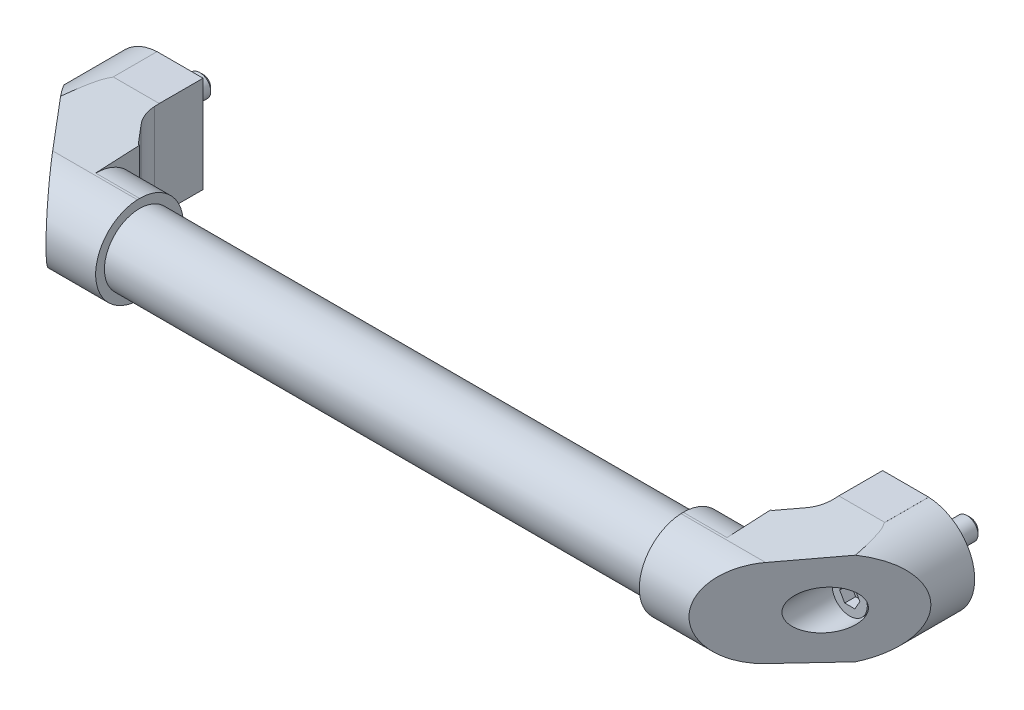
ISO-10303-21;
HEADER;
FILE_DESCRIPTION(('STEP AP214'),'2;1');
FILE_NAME('part.step','',(''),(''),'','','');
FILE_SCHEMA(('AUTOMOTIVE_DESIGN { 1 0 10303 214 1 1 1 1 }'));
ENDSEC;
DATA;
#1=APPLICATION_CONTEXT('core data for automotive mechanical design processes');
#2=APPLICATION_PROTOCOL_DEFINITION('international standard','automotive_design',2000,#1);
#3=PRODUCT_CONTEXT('',#1,'mechanical');
#4=PRODUCT('Part','Part','',(#3));
#5=PRODUCT_RELATED_PRODUCT_CATEGORY('part','',(#4));
#6=PRODUCT_DEFINITION_FORMATION('','',#4);
#7=PRODUCT_DEFINITION_CONTEXT('part definition',#1,'design');
#8=PRODUCT_DEFINITION('design','',#6,#7);
#9=PRODUCT_DEFINITION_SHAPE('','',#8);
#10=(LENGTH_UNIT() NAMED_UNIT(*) SI_UNIT(.MILLI.,.METRE.));
#11=(NAMED_UNIT(*) PLANE_ANGLE_UNIT() SI_UNIT($,.RADIAN.));
#12=(NAMED_UNIT(*) SI_UNIT($,.STERADIAN.) SOLID_ANGLE_UNIT());
#13=UNCERTAINTY_MEASURE_WITH_UNIT(LENGTH_MEASURE(1.E-05),#10,'distance_accuracy_value','');
#14=(GEOMETRIC_REPRESENTATION_CONTEXT(3) GLOBAL_UNCERTAINTY_ASSIGNED_CONTEXT((#13)) GLOBAL_UNIT_ASSIGNED_CONTEXT((#10,
#11,#12)) REPRESENTATION_CONTEXT('',''));
#15=CARTESIAN_POINT('',(0.,0.,0.));
#16=DIRECTION('',(0.,0.,1.));
#17=DIRECTION('',(1.,0.,0.));
#18=AXIS2_PLACEMENT_3D('',#15,#16,#17);
#19=CARTESIAN_POINT('',(0.,0.,25.));
#20=DIRECTION('',(0.,0.,1.));
#21=DIRECTION('',(1.,0.,0.));
#22=AXIS2_PLACEMENT_3D('',#19,#20,#21);
#23=PLANE('',#22);
#24=CARTESIAN_POINT('',(0.,0.,25.));
#25=DIRECTION('',(0.,0.,1.));
#26=DIRECTION('',(1.,0.,0.));
#27=AXIS2_PLACEMENT_3D('',#24,#25,#26);
#28=CIRCLE('',#27,9.);
#29=CARTESIAN_POINT('',(9.,0.,25.));
#30=VERTEX_POINT('',#29);
#31=EDGE_CURVE('E423',#30,#30,#28,.T.);
#32=ORIENTED_EDGE('',*,*,#31,.T.);
#33=EDGE_LOOP('',(#32));
#34=FACE_BOUND('',#33,.T.);
#35=CARTESIAN_POINT('',(0.,0.,25.));
#36=DIRECTION('',(0.,0.,1.));
#37=DIRECTION('',(1.,0.,0.));
#38=AXIS2_PLACEMENT_3D('',#35,#36,#37);
#39=CIRCLE('',#38,8.);
#40=CARTESIAN_POINT('',(8.,0.,25.));
#41=VERTEX_POINT('',#40);
#42=EDGE_CURVE('E404',#41,#41,#39,.T.);
#43=ORIENTED_EDGE('',*,*,#42,.F.);
#44=EDGE_LOOP('',(#43));
#45=FACE_BOUND('',#44,.T.);
#46=ADVANCED_FACE('F14',(#34,#45),#23,.T.);
#47=CARTESIAN_POINT('',(350.,0.,25.));
#48=DIRECTION('',(0.,0.,1.));
#49=DIRECTION('',(1.,0.,0.));
#50=AXIS2_PLACEMENT_3D('',#47,#48,#49);
#51=PLANE('',#50);
#52=CARTESIAN_POINT('',(350.,0.,25.));
#53=DIRECTION('',(0.,0.,1.));
#54=DIRECTION('',(1.,0.,0.));
#55=AXIS2_PLACEMENT_3D('',#52,#53,#54);
#56=CIRCLE('',#55,9.);
#57=CARTESIAN_POINT('',(359.,0.,25.));
#58=VERTEX_POINT('',#57);
#59=EDGE_CURVE('E428',#58,#58,#56,.T.);
#60=ORIENTED_EDGE('',*,*,#59,.T.);
#61=EDGE_LOOP('',(#60));
#62=FACE_BOUND('',#61,.T.);
#63=CARTESIAN_POINT('',(350.,0.,25.));
#64=DIRECTION('',(0.,0.,1.));
#65=DIRECTION('',(1.,0.,0.));
#66=AXIS2_PLACEMENT_3D('',#63,#64,#65);
#67=CIRCLE('',#66,8.);
#68=CARTESIAN_POINT('',(358.,0.,25.));
#69=VERTEX_POINT('',#68);
#70=EDGE_CURVE('E417',#69,#69,#67,.T.);
#71=ORIENTED_EDGE('',*,*,#70,.F.);
#72=EDGE_LOOP('',(#71));
#73=FACE_BOUND('',#72,.T.);
#74=ADVANCED_FACE('F808',(#62,#73),#51,.T.);
#75=CARTESIAN_POINT('',(372.,-19.9756503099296,60.9866076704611));
#76=DIRECTION('',(0.,0.998782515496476,-0.0493303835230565));
#77=DIRECTION('',(0.,0.0493303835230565,0.998782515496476));
#78=AXIS2_PLACEMENT_3D('',#75,#76,#77);
#79=PLANE('',#78);
#80=CARTESIAN_POINT('',(350.,0.,465.429647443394));
#81=DIRECTION('',(0.,0.998782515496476,-0.0493303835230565));
#82=DIRECTION('',(0.,-0.0493303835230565,-0.998782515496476));
#83=AXIS2_PLACEMENT_3D('',#80,#81,#82);
#84=ELLIPSE('',#83,445.972612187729,22.);
#85=CARTESIAN_POINT('',(356.307780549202,-21.0763351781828,38.7012589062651));
#86=VERTEX_POINT('',#85);
#87=CARTESIAN_POINT('',(350.998968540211,-21.9773078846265,20.4594427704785));
#88=VERTEX_POINT('',#87);
#89=EDGE_CURVE('E590',#86,#88,#84,.T.);
#90=ORIENTED_EDGE('',*,*,#89,.F.);
#91=DIRECTION('',(-0.642328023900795,0.0378082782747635,0.765496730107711));
#92=VECTOR('',#91,1.);
#93=CARTESIAN_POINT('',(351.797722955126,-20.8108672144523,44.076136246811));
#94=LINE('',#93,#92);
#95=CARTESIAN_POINT('',(337.608152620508,-19.9756503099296,60.9866076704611));
#96=VERTEX_POINT('',#95);
#97=EDGE_CURVE('E670',#86,#96,#94,.T.);
#98=ORIENTED_EDGE('',*,*,#97,.T.);
#99=DIRECTION('',(-1.,0.,0.));
#100=VECTOR('',#99,1.);
#101=CARTESIAN_POINT('',(372.,-19.9756503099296,60.9866076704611));
#102=LINE('',#101,#100);
#103=CARTESIAN_POINT('',(299.,-19.9756503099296,60.9866076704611));
#104=VERTEX_POINT('',#103);
#105=EDGE_CURVE('E692',#96,#104,#102,.T.);
#106=ORIENTED_EDGE('',*,*,#105,.T.);
#107=DIRECTION('',(0.,-0.0493303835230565,-0.998782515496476));
#108=VECTOR('',#107,1.);
#109=CARTESIAN_POINT('',(299.,-19.9756503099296,60.9866076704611));
#110=LINE('',#109,#108);
#111=CARTESIAN_POINT('',(299.,-20.0243793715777,60.));
#112=VERTEX_POINT('',#111);
#113=EDGE_CURVE('E676',#104,#112,#110,.T.);
#114=ORIENTED_EDGE('',*,*,#113,.T.);
#115=DIRECTION('',(-1.,0.,0.));
#116=VECTOR('',#115,1.);
#117=CARTESIAN_POINT('',(372.,-20.0243793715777,60.));
#118=LINE('',#117,#116);
#119=CARTESIAN_POINT('',(319.,-20.0243793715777,60.));
#120=VERTEX_POINT('',#119);
#121=EDGE_CURVE('E626',#120,#112,#118,.T.);
#122=ORIENTED_EDGE('',*,*,#121,.F.);
#123=DIRECTION('',(0.,0.0493303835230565,0.998782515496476));
#124=VECTOR('',#123,1.);
#125=CARTESIAN_POINT('',(319.,-19.9756503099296,60.9866076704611));
#126=LINE('',#125,#124);
#127=CARTESIAN_POINT('',(319.,-21.0121896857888,40.));
#128=VERTEX_POINT('',#127);
#129=EDGE_CURVE('E621',#128,#120,#126,.T.);
#130=ORIENTED_EDGE('',*,*,#129,.F.);
#131=DIRECTION('',(-1.,0.,0.));
#132=VECTOR('',#131,1.);
#133=CARTESIAN_POINT('',(372.,-21.0121896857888,40.));
#134=LINE('',#133,#132);
#135=CARTESIAN_POINT('',(319.581212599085,-21.0121896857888,40.));
#136=VERTEX_POINT('',#135);
#137=EDGE_CURVE('E652',#136,#128,#134,.T.);
#138=ORIENTED_EDGE('',*,*,#137,.F.);
#139=DIRECTION('',(0.642328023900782,-0.0378082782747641,-0.765496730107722));
#140=VECTOR('',#139,1.);
#141=CARTESIAN_POINT('',(330.864145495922,-21.6763180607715,26.5535241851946));
#142=LINE('',#141,#140);
#143=CARTESIAN_POINT('',(326.510146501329,-21.4200359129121,31.7424181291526));
#144=VERTEX_POINT('',#143);
#145=EDGE_CURVE('E662',#136,#144,#142,.T.);
#146=ORIENTED_EDGE('',*,*,#145,.T.);
#147=CARTESIAN_POINT('',(315.000018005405,-21.8951021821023,22.1238453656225));
#148=DIRECTION('',(0.,0.998782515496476,-0.0493303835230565));
#149=DIRECTION('',(0.,-0.0493303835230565,-0.998782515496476));
#150=AXIS2_PLACEMENT_3D('',#147,#148,#149);
#151=ELLIPSE('',#150,15.0182845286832,15.);
#152=CARTESIAN_POINT('',(330.,-21.8962500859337,22.1006039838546));
#153=VERTEX_POINT('',#152);
#154=EDGE_CURVE('E660',#153,#144,#151,.F.);
#155=ORIENTED_EDGE('',*,*,#154,.F.);
#156=DIRECTION('',(0.,0.0493303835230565,0.998782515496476));
#157=VECTOR('',#156,1.);
#158=CARTESIAN_POINT('',(330.,-19.9756503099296,60.9866076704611));
#159=LINE('',#158,#157);
#160=CARTESIAN_POINT('',(330.,-22.,20.));
#161=VERTEX_POINT('',#160);
#162=EDGE_CURVE('E658',#161,#153,#159,.T.);
#163=ORIENTED_EDGE('',*,*,#162,.F.);
#164=DIRECTION('',(-1.,0.,0.));
#165=VECTOR('',#164,1.);
#166=CARTESIAN_POINT('',(372.,-22.,20.));
#167=LINE('',#166,#165);
#168=CARTESIAN_POINT('',(350.998968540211,-22.,20.));
#169=VERTEX_POINT('',#168);
#170=EDGE_CURVE('E690',#169,#161,#167,.T.);
#171=ORIENTED_EDGE('',*,*,#170,.F.);
#172=DIRECTION('',(0.,-0.0493303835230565,-0.998782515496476));
#173=VECTOR('',#172,1.);
#174=CARTESIAN_POINT('',(350.998968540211,-19.9756503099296,60.9866076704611));
#175=LINE('',#174,#173);
#176=EDGE_CURVE('E595',#88,#169,#175,.T.);
#177=ORIENTED_EDGE('',*,*,#176,.F.);
#178=EDGE_LOOP('',(#90,#98,#106,#114,#122,#130,#138,#146,#155,#163,#171,#177));
#179=FACE_BOUND('',#178,.T.);
#180=ADVANCED_FACE('F16',(#179),#79,.F.);
#181=CARTESIAN_POINT('',(372.,-22.,0.));
#182=DIRECTION('',(0.,0.,1.));
#183=DIRECTION('',(1.,0.,0.));
#184=AXIS2_PLACEMENT_3D('',#181,#182,#183);
#185=PLANE('',#184);
#186=CARTESIAN_POINT('',(350.,0.,0.));
#187=DIRECTION('',(0.,0.,1.));
#188=DIRECTION('',(1.,0.,0.));
#189=AXIS2_PLACEMENT_3D('',#186,#187,#188);
#190=CIRCLE('',#189,4.99999999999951);
#191=CARTESIAN_POINT('',(354.999999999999,0.,0.));
#192=VERTEX_POINT('',#191);
#193=EDGE_CURVE('E704',#192,#192,#190,.F.);
#194=ORIENTED_EDGE('',*,*,#193,.F.);
#195=EDGE_LOOP('',(#194));
#196=FACE_BOUND('',#195,.T.);
#197=DIRECTION('',(-1.,0.,0.));
#198=VECTOR('',#197,1.);
#199=CARTESIAN_POINT('',(372.,22.,0.));
#200=LINE('',#199,#198);
#201=CARTESIAN_POINT('',(350.99896854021,22.,0.));
#202=VERTEX_POINT('',#201);
#203=CARTESIAN_POINT('',(330.,22.,0.));
#204=VERTEX_POINT('',#203);
#205=EDGE_CURVE('E686',#202,#204,#200,.T.);
#206=ORIENTED_EDGE('',*,*,#205,.F.);
#207=DIRECTION('',(0.,1.,0.));
#208=VECTOR('',#207,1.);
#209=CARTESIAN_POINT('',(350.99896854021,21.9773078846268,0.));
#210=LINE('',#209,#208);
#211=CARTESIAN_POINT('',(350.99896854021,21.9773078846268,0.));
#212=VERTEX_POINT('',#211);
#213=EDGE_CURVE('E576',#212,#202,#210,.T.);
#214=ORIENTED_EDGE('',*,*,#213,.F.);
#215=CARTESIAN_POINT('',(350.,0.,0.));
#216=DIRECTION('',(0.,0.,-1.));
#217=DIRECTION('',(-1.,0.,0.));
#218=AXIS2_PLACEMENT_3D('',#215,#216,#217);
#219=CIRCLE('',#218,22.);
#220=CARTESIAN_POINT('',(350.998968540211,-21.9773078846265,0.));
#221=VERTEX_POINT('',#220);
#222=EDGE_CURVE('E578',#212,#221,#219,.T.);
#223=ORIENTED_EDGE('',*,*,#222,.T.);
#224=DIRECTION('',(0.,-1.,0.));
#225=VECTOR('',#224,1.);
#226=CARTESIAN_POINT('',(350.998968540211,-21.9773078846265,0.));
#227=LINE('',#226,#225);
#228=CARTESIAN_POINT('',(350.998968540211,-22.,0.));
#229=VERTEX_POINT('',#228);
#230=EDGE_CURVE('E580',#221,#229,#227,.T.);
#231=ORIENTED_EDGE('',*,*,#230,.T.);
#232=DIRECTION('',(-1.,0.,0.));
#233=VECTOR('',#232,1.);
#234=CARTESIAN_POINT('',(372.,-22.,0.));
#235=LINE('',#234,#233);
#236=CARTESIAN_POINT('',(330.,-22.,0.));
#237=VERTEX_POINT('',#236);
#238=EDGE_CURVE('E688',#229,#237,#235,.T.);
#239=ORIENTED_EDGE('',*,*,#238,.T.);
#240=DIRECTION('',(0.,-1.,0.));
#241=VECTOR('',#240,1.);
#242=CARTESIAN_POINT('',(330.,22.,0.));
#243=LINE('',#242,#241);
#244=EDGE_CURVE('E638',#204,#237,#243,.T.);
#245=ORIENTED_EDGE('',*,*,#244,.F.);
#246=EDGE_LOOP('',(#206,#214,#223,#231,#239,#245));
#247=FACE_BOUND('',#246,.T.);
#248=ADVANCED_FACE('F732',(#196,#247),#185,.F.);
#249=CARTESIAN_POINT('',(372.,-22.,0.));
#250=DIRECTION('',(0.,-1.,0.));
#251=DIRECTION('',(1.,0.,0.));
#252=AXIS2_PLACEMENT_3D('',#249,#250,#251);
#253=PLANE('',#252);
#254=ORIENTED_EDGE('',*,*,#238,.F.);
#255=DIRECTION('',(0.,0.,1.));
#256=VECTOR('',#255,1.);
#257=CARTESIAN_POINT('',(350.998968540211,-22.,0.));
#258=LINE('',#257,#256);
#259=EDGE_CURVE('E9',#229,#169,#258,.T.);
#260=ORIENTED_EDGE('',*,*,#259,.T.);
#261=ORIENTED_EDGE('',*,*,#170,.T.);
#262=DIRECTION('',(0.,0.,-1.));
#263=VECTOR('',#262,1.);
#264=CARTESIAN_POINT('',(330.,-22.,0.));
#265=LINE('',#264,#263);
#266=EDGE_CURVE('E655',#161,#237,#265,.T.);
#267=ORIENTED_EDGE('',*,*,#266,.T.);
#268=EDGE_LOOP('',(#254,#260,#261,#267));
#269=FACE_BOUND('',#268,.T.);
#270=ADVANCED_FACE('F737',(#269),#253,.T.);
#271=CARTESIAN_POINT('',(372.,-22.,20.));
#272=DIRECTION('',(-0.766044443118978,0.,-0.64278760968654));
#273=DIRECTION('',(-0.64278760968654,0.,0.766044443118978));
#274=AXIS2_PLACEMENT_3D('',#271,#272,#273);
#275=PLANE('',#274);
#276=CARTESIAN_POINT('',(350.,0.,46.2185790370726));
#277=DIRECTION('',(-0.766044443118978,0.,-0.64278760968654));
#278=DIRECTION('',(-0.64278760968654,0.,0.766044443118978));
#279=AXIS2_PLACEMENT_3D('',#276,#277,#278);
#280=ELLIPSE('',#279,14.0015144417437,9.);
#281=CARTESIAN_POINT('',(341.,0.,56.9443613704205));
#282=VERTEX_POINT('',#281);
#283=EDGE_CURVE('E628',#282,#282,#280,.T.);
#284=ORIENTED_EDGE('',*,*,#283,.T.);
#285=EDGE_LOOP('',(#284));
#286=FACE_BOUND('',#285,.T.);
#287=ORIENTED_EDGE('',*,*,#97,.F.);
#288=CARTESIAN_POINT('',(350.,0.,46.2185790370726));
#289=DIRECTION('',(-0.766044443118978,0.,-0.64278760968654));
#290=DIRECTION('',(0.64278760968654,0.,-0.766044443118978));
#291=AXIS2_PLACEMENT_3D('',#288,#289,#290);
#292=ELLIPSE('',#291,34.225924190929,22.);
#293=CARTESIAN_POINT('',(356.307780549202,21.076335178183,38.7012589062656));
#294=VERTEX_POINT('',#293);
#295=EDGE_CURVE('E713',#294,#86,#292,.T.);
#296=ORIENTED_EDGE('',*,*,#295,.F.);
#297=DIRECTION('',(0.642328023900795,0.0378082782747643,-0.765496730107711));
#298=VECTOR('',#297,1.);
#299=CARTESIAN_POINT('',(372.,22.,20.));
#300=LINE('',#299,#298);
#301=CARTESIAN_POINT('',(337.608152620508,19.9756503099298,60.9866076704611));
#302=VERTEX_POINT('',#301);
#303=EDGE_CURVE('E665',#302,#294,#300,.T.);
#304=ORIENTED_EDGE('',*,*,#303,.F.);
#305=CARTESIAN_POINT('',(338.436014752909,0.,60.));
#306=DIRECTION('',(-0.766044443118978,0.,-0.64278760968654));
#307=DIRECTION('',(-0.64278760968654,0.,0.766044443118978));
#308=AXIS2_PLACEMENT_3D('',#305,#306,#307);
#309=ELLIPSE('',#308,26.1081457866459,20.);
#310=EDGE_CURVE('E668',#96,#302,#309,.T.);
#311=ORIENTED_EDGE('',*,*,#310,.F.);
#312=EDGE_LOOP('',(#287,#296,#304,#311));
#313=FACE_BOUND('',#312,.T.);
#314=ADVANCED_FACE('F787',(#286,#313),#275,.F.);
#315=CARTESIAN_POINT('',(299.,0.,60.));
#316=DIRECTION('',(1.,0.,0.));
#317=DIRECTION('',(0.,1.,0.));
#318=AXIS2_PLACEMENT_3D('',#315,#316,#317);
#319=PLANE('',#318);
#320=CARTESIAN_POINT('',(299.,0.,60.));
#321=DIRECTION('',(1.,0.,0.));
#322=DIRECTION('',(0.,1.,0.));
#323=AXIS2_PLACEMENT_3D('',#320,#321,#322);
#324=CIRCLE('',#323,16.);
#325=CARTESIAN_POINT('',(299.,16.,60.));
#326=VERTEX_POINT('',#325);
#327=EDGE_CURVE('E672',#326,#326,#324,.T.);
#328=ORIENTED_EDGE('',*,*,#327,.T.);
#329=EDGE_LOOP('',(#328));
#330=FACE_BOUND('',#329,.T.);
#331=DIRECTION('',(0.,-1.,0.));
#332=VECTOR('',#331,1.);
#333=CARTESIAN_POINT('',(299.,-20.,60.));
#334=LINE('',#333,#332);
#335=CARTESIAN_POINT('',(299.,-20.,60.));
#336=VERTEX_POINT('',#335);
#337=EDGE_CURVE('E599',#336,#112,#334,.T.);
#338=ORIENTED_EDGE('',*,*,#337,.T.);
#339=ORIENTED_EDGE('',*,*,#113,.F.);
#340=CARTESIAN_POINT('',(299.,0.,60.));
#341=DIRECTION('',(1.,0.,0.));
#342=DIRECTION('',(0.,1.,0.));
#343=AXIS2_PLACEMENT_3D('',#340,#341,#342);
#344=CIRCLE('',#343,20.);
#345=CARTESIAN_POINT('',(299.,19.9756503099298,60.9866076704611));
#346=VERTEX_POINT('',#345);
#347=EDGE_CURVE('E673',#346,#104,#344,.T.);
#348=ORIENTED_EDGE('',*,*,#347,.F.);
#349=DIRECTION('',(0.,-0.0493303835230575,0.998782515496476));
#350=VECTOR('',#349,1.);
#351=CARTESIAN_POINT('',(299.,22.,20.));
#352=LINE('',#351,#350);
#353=CARTESIAN_POINT('',(299.,20.0243793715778,60.));
#354=VERTEX_POINT('',#353);
#355=EDGE_CURVE('E679',#354,#346,#352,.T.);
#356=ORIENTED_EDGE('',*,*,#355,.F.);
#357=DIRECTION('',(0.,1.,0.));
#358=VECTOR('',#357,1.);
#359=CARTESIAN_POINT('',(299.,20.,60.));
#360=LINE('',#359,#358);
#361=CARTESIAN_POINT('',(299.,20.,60.));
#362=VERTEX_POINT('',#361);
#363=EDGE_CURVE('E602',#362,#354,#360,.T.);
#364=ORIENTED_EDGE('',*,*,#363,.F.);
#365=CARTESIAN_POINT('',(299.,0.,60.));
#366=DIRECTION('',(-1.,0.,0.));
#367=DIRECTION('',(0.,-1.,0.));
#368=AXIS2_PLACEMENT_3D('',#365,#366,#367);
#369=CIRCLE('',#368,20.);
#370=EDGE_CURVE('E597',#362,#336,#369,.T.);
#371=ORIENTED_EDGE('',*,*,#370,.T.);
#372=EDGE_LOOP('',(#338,#339,#348,#356,#364,#371));
#373=FACE_BOUND('',#372,.T.);
#374=ADVANCED_FACE('F777',(#330,#373),#319,.F.);
#375=CARTESIAN_POINT('',(299.,22.,40.));
#376=DIRECTION('',(0.,0.,-1.));
#377=DIRECTION('',(-1.,0.,0.));
#378=AXIS2_PLACEMENT_3D('',#375,#376,#377);
#379=PLANE('',#378);
#380=ORIENTED_EDGE('',*,*,#137,.T.);
#381=DIRECTION('',(0.,1.,0.));
#382=VECTOR('',#381,1.);
#383=CARTESIAN_POINT('',(319.,22.,40.));
#384=LINE('',#383,#382);
#385=CARTESIAN_POINT('',(319.,0.,40.));
#386=VERTEX_POINT('',#385);
#387=EDGE_CURVE('E712',#128,#386,#384,.T.);
#388=ORIENTED_EDGE('',*,*,#387,.T.);
#389=CARTESIAN_POINT('',(319.,21.012189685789,40.));
#390=VERTEX_POINT('',#389);
#391=EDGE_CURVE('E707',#386,#390,#384,.T.);
#392=ORIENTED_EDGE('',*,*,#391,.T.);
#393=DIRECTION('',(1.,0.,0.));
#394=VECTOR('',#393,1.);
#395=CARTESIAN_POINT('',(372.,21.012189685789,40.));
#396=LINE('',#395,#394);
#397=CARTESIAN_POINT('',(319.581212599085,21.012189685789,40.));
#398=VERTEX_POINT('',#397);
#399=EDGE_CURVE('E650',#390,#398,#396,.T.);
#400=ORIENTED_EDGE('',*,*,#399,.T.);
#401=DIRECTION('',(0.,-1.,0.));
#402=VECTOR('',#401,1.);
#403=CARTESIAN_POINT('',(319.581212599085,22.,40.));
#404=LINE('',#403,#402);
#405=EDGE_CURVE('E647',#398,#136,#404,.T.);
#406=ORIENTED_EDGE('',*,*,#405,.T.);
#407=EDGE_LOOP('',(#380,#388,#392,#400,#406));
#408=FACE_BOUND('',#407,.T.);
#409=ADVANCED_FACE('F755',(#408),#379,.T.);
#410=CARTESIAN_POINT('',(372.,22.,0.));
#411=DIRECTION('',(0.,-1.,0.));
#412=DIRECTION('',(1.,0.,0.));
#413=AXIS2_PLACEMENT_3D('',#410,#411,#412);
#414=PLANE('',#413);
#415=DIRECTION('',(-1.,0.,0.));
#416=VECTOR('',#415,1.);
#417=CARTESIAN_POINT('',(372.,22.,20.));
#418=LINE('',#417,#416);
#419=CARTESIAN_POINT('',(350.99896854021,22.,20.));
#420=VERTEX_POINT('',#419);
#421=CARTESIAN_POINT('',(330.,22.,20.));
#422=VERTEX_POINT('',#421);
#423=EDGE_CURVE('E684',#420,#422,#418,.T.);
#424=ORIENTED_EDGE('',*,*,#423,.F.);
#425=DIRECTION('',(0.,0.,-1.));
#426=VECTOR('',#425,1.);
#427=CARTESIAN_POINT('',(350.99896854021,22.,0.));
#428=LINE('',#427,#426);
#429=EDGE_CURVE('E592',#420,#202,#428,.T.);
#430=ORIENTED_EDGE('',*,*,#429,.T.);
#431=ORIENTED_EDGE('',*,*,#205,.T.);
#432=DIRECTION('',(0.,0.,-1.));
#433=VECTOR('',#432,1.);
#434=CARTESIAN_POINT('',(330.,22.,22.1006039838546));
#435=LINE('',#434,#433);
#436=EDGE_CURVE('E635',#422,#204,#435,.T.);
#437=ORIENTED_EDGE('',*,*,#436,.F.);
#438=EDGE_LOOP('',(#424,#430,#431,#437));
#439=FACE_BOUND('',#438,.T.);
#440=ADVANCED_FACE('F724',(#439),#414,.F.);
#441=CARTESIAN_POINT('',(372.,22.,20.));
#442=DIRECTION('',(0.,-0.998782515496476,-0.0493303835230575));
#443=DIRECTION('',(0.,0.0493303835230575,-0.998782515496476));
#444=AXIS2_PLACEMENT_3D('',#441,#442,#443);
#445=PLANE('',#444);
#446=CARTESIAN_POINT('',(350.,0.,465.429647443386));
#447=DIRECTION('',(0.,-0.998782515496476,-0.0493303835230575));
#448=DIRECTION('',(0.,0.0493303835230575,-0.998782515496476));
#449=AXIS2_PLACEMENT_3D('',#446,#447,#448);
#450=ELLIPSE('',#449,445.97261218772,22.);
#451=CARTESIAN_POINT('',(350.99896854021,21.9773078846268,20.4594427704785));
#452=VERTEX_POINT('',#451);
#453=EDGE_CURVE('E588',#452,#294,#450,.T.);
#454=ORIENTED_EDGE('',*,*,#453,.F.);
#455=DIRECTION('',(0.,0.0493303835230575,-0.998782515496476));
#456=VECTOR('',#455,1.);
#457=CARTESIAN_POINT('',(350.99896854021,22.,20.));
#458=LINE('',#457,#456);
#459=EDGE_CURVE('E22',#452,#420,#458,.T.);
#460=ORIENTED_EDGE('',*,*,#459,.T.);
#461=ORIENTED_EDGE('',*,*,#423,.T.);
#462=DIRECTION('',(0.,0.0493303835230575,-0.998782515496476));
#463=VECTOR('',#462,1.);
#464=CARTESIAN_POINT('',(330.,22.,20.));
#465=LINE('',#464,#463);
#466=CARTESIAN_POINT('',(330.,21.8962500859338,22.1006039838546));
#467=VERTEX_POINT('',#466);
#468=EDGE_CURVE('E694',#467,#422,#465,.T.);
#469=ORIENTED_EDGE('',*,*,#468,.F.);
#470=CARTESIAN_POINT('',(315.000018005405,21.8951021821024,22.1238453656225));
#471=DIRECTION('',(0.,-0.998782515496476,-0.0493303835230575));
#472=DIRECTION('',(0.,-0.0493303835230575,0.998782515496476));
#473=AXIS2_PLACEMENT_3D('',#470,#471,#472);
#474=ELLIPSE('',#473,15.0182845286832,15.);
#475=CARTESIAN_POINT('',(326.510146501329,21.4200359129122,31.7424181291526));
#476=VERTEX_POINT('',#475);
#477=EDGE_CURVE('E699',#476,#467,#474,.F.);
#478=ORIENTED_EDGE('',*,*,#477,.F.);
#479=DIRECTION('',(-0.642328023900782,-0.0378082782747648,0.765496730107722));
#480=VECTOR('',#479,1.);
#481=CARTESIAN_POINT('',(351.066422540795,22.8654508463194,2.47738793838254));
#482=LINE('',#481,#480);
#483=EDGE_CURVE('E701',#476,#398,#482,.T.);
#484=ORIENTED_EDGE('',*,*,#483,.T.);
#485=ORIENTED_EDGE('',*,*,#399,.F.);
#486=DIRECTION('',(0.,0.0493303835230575,-0.998782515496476));
#487=VECTOR('',#486,1.);
#488=CARTESIAN_POINT('',(319.,22.,20.));
#489=LINE('',#488,#487);
#490=CARTESIAN_POINT('',(319.,20.0243793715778,60.));
#491=VERTEX_POINT('',#490);
#492=EDGE_CURVE('E619',#491,#390,#489,.T.);
#493=ORIENTED_EDGE('',*,*,#492,.F.);
#494=DIRECTION('',(-1.,0.,0.));
#495=VECTOR('',#494,1.);
#496=CARTESIAN_POINT('',(372.,20.0243793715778,60.));
#497=LINE('',#496,#495);
#498=EDGE_CURVE('E623',#491,#354,#497,.T.);
#499=ORIENTED_EDGE('',*,*,#498,.T.);
#500=ORIENTED_EDGE('',*,*,#355,.T.);
#501=DIRECTION('',(-1.,0.,0.));
#502=VECTOR('',#501,1.);
#503=CARTESIAN_POINT('',(372.,19.9756503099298,60.9866076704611));
#504=LINE('',#503,#502);
#505=EDGE_CURVE('E681',#302,#346,#504,.T.);
#506=ORIENTED_EDGE('',*,*,#505,.F.);
#507=ORIENTED_EDGE('',*,*,#303,.T.);
#508=EDGE_LOOP('',(#454,#460,#461,#469,#478,#484,#485,#493,#499,#500,#506,#507));
#509=FACE_BOUND('',#508,.T.);
#510=ADVANCED_FACE('F718',(#509),#445,.F.);
#511=CARTESIAN_POINT('',(372.,0.,60.));
#512=DIRECTION('',(-1.,0.,0.));
#513=DIRECTION('',(0.,-1.,0.));
#514=AXIS2_PLACEMENT_3D('',#511,#512,#513);
#515=CYLINDRICAL_SURFACE('',#514,20.);
#516=ORIENTED_EDGE('',*,*,#310,.T.);
#517=ORIENTED_EDGE('',*,*,#505,.T.);
#518=ORIENTED_EDGE('',*,*,#347,.T.);
#519=ORIENTED_EDGE('',*,*,#105,.F.);
#520=EDGE_LOOP('',(#516,#517,#518,#519));
#521=FACE_BOUND('',#520,.T.);
#522=ADVANCED_FACE('F781',(#521),#515,.T.);
#523=CARTESIAN_POINT('',(341.182067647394,0.,60.));
#524=DIRECTION('',(1.,0.,0.));
#525=DIRECTION('',(0.,1.,0.));
#526=AXIS2_PLACEMENT_3D('',#523,#524,#525);
#527=CYLINDRICAL_SURFACE('',#526,16.);
#528=ORIENTED_EDGE('',*,*,#327,.F.);
#529=EDGE_LOOP('',(#528));
#530=FACE_BOUND('',#529,.T.);
#531=CARTESIAN_POINT('',(51.,0.,60.));
#532=DIRECTION('',(1.,0.,0.));
#533=DIRECTION('',(0.,1.,0.));
#534=AXIS2_PLACEMENT_3D('',#531,#532,#533);
#535=CIRCLE('',#534,16.);
#536=CARTESIAN_POINT('',(51.,16.,60.));
#537=VERTEX_POINT('',#536);
#538=EDGE_CURVE('E527',#537,#537,#535,.T.);
#539=ORIENTED_EDGE('',*,*,#538,.T.);
#540=EDGE_LOOP('',(#539));
#541=FACE_BOUND('',#540,.T.);
#542=ADVANCED_FACE('F1251',(#530,#541),#527,.T.);
#543=CARTESIAN_POINT('',(326.510146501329,22.,31.7424181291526));
#544=DIRECTION('',(0.766044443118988,0.,0.642787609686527));
#545=DIRECTION('',(0.642787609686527,0.,-0.766044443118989));
#546=AXIS2_PLACEMENT_3D('',#543,#544,#545);
#547=PLANE('',#546);
#548=ORIENTED_EDGE('',*,*,#405,.F.);
#549=ORIENTED_EDGE('',*,*,#483,.F.);
#550=DIRECTION('',(0.,-1.,0.));
#551=VECTOR('',#550,1.);
#552=CARTESIAN_POINT('',(326.510146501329,22.,31.7424181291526));
#553=LINE('',#552,#551);
#554=EDGE_CURVE('E644',#476,#144,#553,.T.);
#555=ORIENTED_EDGE('',*,*,#554,.T.);
#556=ORIENTED_EDGE('',*,*,#145,.F.);
#557=EDGE_LOOP('',(#548,#549,#555,#556));
#558=FACE_BOUND('',#557,.T.);
#559=ADVANCED_FACE('F751',(#558),#547,.F.);
#560=CARTESIAN_POINT('',(315.000018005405,22.,22.1238453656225));
#561=DIRECTION('',(0.,-1.,0.));
#562=DIRECTION('',(1.,0.,0.));
#563=AXIS2_PLACEMENT_3D('',#560,#561,#562);
#564=CYLINDRICAL_SURFACE('',#563,15.);
#565=ORIENTED_EDGE('',*,*,#154,.T.);
#566=ORIENTED_EDGE('',*,*,#554,.F.);
#567=ORIENTED_EDGE('',*,*,#477,.T.);
#568=DIRECTION('',(0.,-1.,0.));
#569=VECTOR('',#568,1.);
#570=CARTESIAN_POINT('',(330.,22.,22.1006039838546));
#571=LINE('',#570,#569);
#572=EDGE_CURVE('E641',#467,#153,#571,.T.);
#573=ORIENTED_EDGE('',*,*,#572,.T.);
#574=EDGE_LOOP('',(#565,#566,#567,#573));
#575=FACE_BOUND('',#574,.T.);
#576=ADVANCED_FACE('F747',(#575),#564,.F.);
#577=CARTESIAN_POINT('',(330.,22.,22.1006039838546));
#578=DIRECTION('',(-1.,0.,0.));
#579=DIRECTION('',(0.,-1.,0.));
#580=AXIS2_PLACEMENT_3D('',#577,#578,#579);
#581=PLANE('',#580);
#582=ORIENTED_EDGE('',*,*,#162,.T.);
#583=ORIENTED_EDGE('',*,*,#572,.F.);
#584=ORIENTED_EDGE('',*,*,#468,.T.);
#585=ORIENTED_EDGE('',*,*,#436,.T.);
#586=ORIENTED_EDGE('',*,*,#244,.T.);
#587=ORIENTED_EDGE('',*,*,#266,.F.);
#588=EDGE_LOOP('',(#582,#583,#584,#585,#586,#587));
#589=FACE_BOUND('',#588,.T.);
#590=ADVANCED_FACE('F728',(#589),#581,.T.);
#591=CARTESIAN_POINT('',(350.,0.,31.7424181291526));
#592=DIRECTION('',(0.,0.,1.));
#593=DIRECTION('',(0.,-1.,0.));
#594=AXIS2_PLACEMENT_3D('',#591,#592,#593);
#595=CYLINDRICAL_SURFACE('',#594,4.99999999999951);
#596=CARTESIAN_POINT('',(350.,0.,-18.5));
#597=DIRECTION('',(0.,0.,1.));
#598=DIRECTION('',(0.,-1.,0.));
#599=AXIS2_PLACEMENT_3D('',#596,#597,#598);
#600=CIRCLE('',#599,4.99999999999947);
#601=CARTESIAN_POINT('',(350.,-4.99999999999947,-18.5));
#602=VERTEX_POINT('',#601);
#603=EDGE_CURVE('E629',#602,#602,#600,.T.);
#604=ORIENTED_EDGE('',*,*,#603,.T.);
#605=EDGE_LOOP('',(#604));
#606=FACE_BOUND('',#605,.T.);
#607=ORIENTED_EDGE('',*,*,#193,.T.);
#608=EDGE_LOOP('',(#607));
#609=FACE_BOUND('',#608,.T.);
#610=ADVANCED_FACE('F1204',(#606,#609),#595,.T.);
#611=CARTESIAN_POINT('',(350.,0.,-20.));
#612=DIRECTION('',(0.,0.,1.));
#613=DIRECTION('',(0.,-1.,0.));
#614=AXIS2_PLACEMENT_3D('',#611,#612,#613);
#615=PLANE('',#614);
#616=CARTESIAN_POINT('',(350.,0.,-20.));
#617=DIRECTION('',(0.,0.,1.));
#618=DIRECTION('',(0.,-1.,0.));
#619=AXIS2_PLACEMENT_3D('',#616,#617,#618);
#620=CIRCLE('',#619,3.49999999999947);
#621=CARTESIAN_POINT('',(350.,-3.49999999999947,-20.));
#622=VERTEX_POINT('',#621);
#623=EDGE_CURVE('E632',#622,#622,#620,.T.);
#624=ORIENTED_EDGE('',*,*,#623,.F.);
#625=EDGE_LOOP('',(#624));
#626=FACE_BOUND('',#625,.T.);
#627=ADVANCED_FACE('F1209',(#626),#615,.F.);
#628=CARTESIAN_POINT('',(350.,0.,-20.));
#629=DIRECTION('',(0.,0.,1.));
#630=DIRECTION('',(0.,-1.,0.));
#631=AXIS2_PLACEMENT_3D('',#628,#629,#630);
#632=CONICAL_SURFACE('',#631,3.49999999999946,0.785398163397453);
#633=ORIENTED_EDGE('',*,*,#603,.F.);
#634=EDGE_LOOP('',(#633));
#635=FACE_BOUND('',#634,.T.);
#636=ORIENTED_EDGE('',*,*,#623,.T.);
#637=EDGE_LOOP('',(#636));
#638=FACE_BOUND('',#637,.T.);
#639=ADVANCED_FACE('F1156',(#635,#638),#632,.T.);
#640=CARTESIAN_POINT('',(350.,0.,30.));
#641=DIRECTION('',(0.,0.,1.));
#642=DIRECTION('',(1.,0.,0.));
#643=AXIS2_PLACEMENT_3D('',#640,#641,#642);
#644=CYLINDRICAL_SURFACE('',#643,9.);
#645=ORIENTED_EDGE('',*,*,#283,.F.);
#646=EDGE_LOOP('',(#645));
#647=FACE_BOUND('',#646,.T.);
#648=ORIENTED_EDGE('',*,*,#59,.F.);
#649=EDGE_LOOP('',(#648));
#650=FACE_BOUND('',#649,.T.);
#651=ADVANCED_FACE('F1150',(#647,#650),#644,.F.);
#652=CARTESIAN_POINT('',(319.,-20.,60.));
#653=DIRECTION('',(0.,0.,-1.));
#654=DIRECTION('',(-1.,0.,0.));
#655=AXIS2_PLACEMENT_3D('',#652,#653,#654);
#656=PLANE('',#655);
#657=ORIENTED_EDGE('',*,*,#121,.T.);
#658=ORIENTED_EDGE('',*,*,#337,.F.);
#659=DIRECTION('',(-1.,0.,0.));
#660=VECTOR('',#659,1.);
#661=CARTESIAN_POINT('',(319.,-20.,60.));
#662=LINE('',#661,#660);
#663=CARTESIAN_POINT('',(319.,-20.,60.));
#664=VERTEX_POINT('',#663);
#665=EDGE_CURVE('E616',#664,#336,#662,.T.);
#666=ORIENTED_EDGE('',*,*,#665,.F.);
#667=DIRECTION('',(0.,-1.,0.));
#668=VECTOR('',#667,1.);
#669=CARTESIAN_POINT('',(319.,-20.,60.));
#670=LINE('',#669,#668);
#671=EDGE_CURVE('E608',#664,#120,#670,.T.);
#672=ORIENTED_EDGE('',*,*,#671,.T.);
#673=EDGE_LOOP('',(#657,#658,#666,#672));
#674=FACE_BOUND('',#673,.T.);
#675=ADVANCED_FACE('F1155',(#674),#656,.T.);
#676=CARTESIAN_POINT('',(319.,20.,60.));
#677=DIRECTION('',(0.,0.,1.));
#678=DIRECTION('',(1.,0.,0.));
#679=AXIS2_PLACEMENT_3D('',#676,#677,#678);
#680=PLANE('',#679);
#681=DIRECTION('',(0.,1.,0.));
#682=VECTOR('',#681,1.);
#683=CARTESIAN_POINT('',(319.,20.,60.));
#684=LINE('',#683,#682);
#685=CARTESIAN_POINT('',(319.,20.,60.));
#686=VERTEX_POINT('',#685);
#687=EDGE_CURVE('E611',#686,#491,#684,.T.);
#688=ORIENTED_EDGE('',*,*,#687,.F.);
#689=DIRECTION('',(-1.,0.,0.));
#690=VECTOR('',#689,1.);
#691=CARTESIAN_POINT('',(319.,20.,60.));
#692=LINE('',#691,#690);
#693=EDGE_CURVE('E614',#686,#362,#692,.T.);
#694=ORIENTED_EDGE('',*,*,#693,.T.);
#695=ORIENTED_EDGE('',*,*,#363,.T.);
#696=ORIENTED_EDGE('',*,*,#498,.F.);
#697=EDGE_LOOP('',(#688,#694,#695,#696));
#698=FACE_BOUND('',#697,.T.);
#699=ADVANCED_FACE('F772',(#698),#680,.F.);
#700=CARTESIAN_POINT('',(319.,0.,60.));
#701=DIRECTION('',(-1.,0.,0.));
#702=DIRECTION('',(0.,-1.,0.));
#703=AXIS2_PLACEMENT_3D('',#700,#701,#702);
#704=CYLINDRICAL_SURFACE('',#703,20.);
#705=CARTESIAN_POINT('',(319.,0.,60.));
#706=DIRECTION('',(-1.,0.,0.));
#707=DIRECTION('',(0.,-1.,0.));
#708=AXIS2_PLACEMENT_3D('',#705,#706,#707);
#709=CIRCLE('',#708,20.);
#710=EDGE_CURVE('E605',#686,#386,#709,.T.);
#711=ORIENTED_EDGE('',*,*,#710,.T.);
#712=EDGE_CURVE('E604',#386,#664,#709,.T.);
#713=ORIENTED_EDGE('',*,*,#712,.T.);
#714=ORIENTED_EDGE('',*,*,#665,.T.);
#715=ORIENTED_EDGE('',*,*,#370,.F.);
#716=ORIENTED_EDGE('',*,*,#693,.F.);
#717=EDGE_LOOP('',(#711,#713,#714,#715,#716));
#718=FACE_BOUND('',#717,.T.);
#719=ADVANCED_FACE('F768',(#718),#704,.T.);
#720=CARTESIAN_POINT('',(319.,0.,60.));
#721=DIRECTION('',(-1.,0.,0.));
#722=DIRECTION('',(0.,-1.,0.));
#723=AXIS2_PLACEMENT_3D('',#720,#721,#722);
#724=PLANE('',#723);
#725=ORIENTED_EDGE('',*,*,#129,.T.);
#726=ORIENTED_EDGE('',*,*,#671,.F.);
#727=ORIENTED_EDGE('',*,*,#712,.F.);
#728=ORIENTED_EDGE('',*,*,#387,.F.);
#729=EDGE_LOOP('',(#725,#726,#727,#728));
#730=FACE_BOUND('',#729,.T.);
#731=ADVANCED_FACE('F764',(#730),#724,.T.);
#732=ORIENTED_EDGE('',*,*,#492,.T.);
#733=ORIENTED_EDGE('',*,*,#391,.F.);
#734=ORIENTED_EDGE('',*,*,#710,.F.);
#735=ORIENTED_EDGE('',*,*,#687,.T.);
#736=EDGE_LOOP('',(#732,#733,#734,#735));
#737=FACE_BOUND('',#736,.T.);
#738=ADVANCED_FACE('F760',(#737),#724,.T.);
#739=CARTESIAN_POINT('',(350.998968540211,-21.9773078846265,80.));
#740=DIRECTION('',(1.,0.,0.));
#741=DIRECTION('',(0.,1.,0.));
#742=AXIS2_PLACEMENT_3D('',#739,#740,#741);
#743=PLANE('',#742);
#744=ORIENTED_EDGE('',*,*,#176,.T.);
#745=ORIENTED_EDGE('',*,*,#259,.F.);
#746=ORIENTED_EDGE('',*,*,#230,.F.);
#747=DIRECTION('',(0.,0.,-1.));
#748=VECTOR('',#747,1.);
#749=CARTESIAN_POINT('',(350.998968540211,-21.9773078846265,80.));
#750=LINE('',#749,#748);
#751=EDGE_CURVE('E583',#88,#221,#750,.T.);
#752=ORIENTED_EDGE('',*,*,#751,.F.);
#753=EDGE_LOOP('',(#744,#745,#746,#752));
#754=FACE_BOUND('',#753,.T.);
#755=ADVANCED_FACE('F792',(#754),#743,.T.);
#756=CARTESIAN_POINT('',(350.99896854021,21.9773078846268,80.));
#757=DIRECTION('',(-1.,0.,0.));
#758=DIRECTION('',(0.,-1.,0.));
#759=AXIS2_PLACEMENT_3D('',#756,#757,#758);
#760=PLANE('',#759);
#761=ORIENTED_EDGE('',*,*,#459,.F.);
#762=DIRECTION('',(0.,0.,-1.));
#763=VECTOR('',#762,1.);
#764=CARTESIAN_POINT('',(350.99896854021,21.9773078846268,80.));
#765=LINE('',#764,#763);
#766=EDGE_CURVE('E586',#452,#212,#765,.T.);
#767=ORIENTED_EDGE('',*,*,#766,.T.);
#768=ORIENTED_EDGE('',*,*,#213,.T.);
#769=ORIENTED_EDGE('',*,*,#429,.F.);
#770=EDGE_LOOP('',(#761,#767,#768,#769));
#771=FACE_BOUND('',#770,.T.);
#772=ADVANCED_FACE('F794',(#771),#760,.F.);
#773=CARTESIAN_POINT('',(350.,0.,80.));
#774=DIRECTION('',(0.,0.,-1.));
#775=DIRECTION('',(-1.,0.,0.));
#776=AXIS2_PLACEMENT_3D('',#773,#774,#775);
#777=CYLINDRICAL_SURFACE('',#776,22.);
#778=ORIENTED_EDGE('',*,*,#295,.T.);
#779=ORIENTED_EDGE('',*,*,#89,.T.);
#780=ORIENTED_EDGE('',*,*,#751,.T.);
#781=ORIENTED_EDGE('',*,*,#222,.F.);
#782=ORIENTED_EDGE('',*,*,#766,.F.);
#783=ORIENTED_EDGE('',*,*,#453,.T.);
#784=EDGE_LOOP('',(#778,#779,#780,#781,#782,#783));
#785=FACE_BOUND('',#784,.T.);
#786=ADVANCED_FACE('F789',(#785),#777,.T.);
#787=CARTESIAN_POINT('',(-22.,-19.9756503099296,60.9866076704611));
#788=DIRECTION('',(0.,0.998782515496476,-0.0493303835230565));
#789=DIRECTION('',(0.,0.0493303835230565,0.998782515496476));
#790=AXIS2_PLACEMENT_3D('',#787,#788,#789);
#791=PLANE('',#790);
#792=CARTESIAN_POINT('',(0.,0.,465.429647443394));
#793=DIRECTION('',(0.,-0.998782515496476,0.0493303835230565));
#794=DIRECTION('',(0.,-0.0493303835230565,-0.998782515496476));
#795=AXIS2_PLACEMENT_3D('',#792,#793,#794);
#796=ELLIPSE('',#795,445.972612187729,22.);
#797=CARTESIAN_POINT('',(-6.307780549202,-21.0763351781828,38.7012589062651));
#798=VERTEX_POINT('',#797);
#799=CARTESIAN_POINT('',(-0.998968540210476,-21.9773078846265,20.4594427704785));
#800=VERTEX_POINT('',#799);
#801=EDGE_CURVE('E445',#798,#800,#796,.T.);
#802=ORIENTED_EDGE('',*,*,#801,.T.);
#803=DIRECTION('',(0.,-0.0493303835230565,-0.998782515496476));
#804=VECTOR('',#803,1.);
#805=CARTESIAN_POINT('',(-0.998968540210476,-19.9756503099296,60.9866076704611));
#806=LINE('',#805,#804);
#807=CARTESIAN_POINT('',(-0.998968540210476,-22.,20.));
#808=VERTEX_POINT('',#807);
#809=EDGE_CURVE('E450',#800,#808,#806,.T.);
#810=ORIENTED_EDGE('',*,*,#809,.T.);
#811=DIRECTION('',(1.,0.,0.));
#812=VECTOR('',#811,1.);
#813=CARTESIAN_POINT('',(-22.,-22.,20.));
#814=LINE('',#813,#812);
#815=CARTESIAN_POINT('',(20.,-22.,20.));
#816=VERTEX_POINT('',#815);
#817=EDGE_CURVE('E545',#808,#816,#814,.T.);
#818=ORIENTED_EDGE('',*,*,#817,.T.);
#819=DIRECTION('',(0.,0.0493303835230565,0.998782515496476));
#820=VECTOR('',#819,1.);
#821=CARTESIAN_POINT('',(20.,-19.9756503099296,60.9866076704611));
#822=LINE('',#821,#820);
#823=CARTESIAN_POINT('',(20.,-21.8962500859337,22.1006039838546));
#824=VERTEX_POINT('',#823);
#825=EDGE_CURVE('E513',#816,#824,#822,.T.);
#826=ORIENTED_EDGE('',*,*,#825,.T.);
#827=CARTESIAN_POINT('',(34.999981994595,-21.8951021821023,22.1238453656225));
#828=DIRECTION('',(0.,-0.998782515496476,0.0493303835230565));
#829=DIRECTION('',(0.,-0.0493303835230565,-0.998782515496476));
#830=AXIS2_PLACEMENT_3D('',#827,#828,#829);
#831=ELLIPSE('',#830,15.0182845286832,15.);
#832=CARTESIAN_POINT('',(23.489853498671,-21.4200359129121,31.7424181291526));
#833=VERTEX_POINT('',#832);
#834=EDGE_CURVE('E515',#824,#833,#831,.F.);
#835=ORIENTED_EDGE('',*,*,#834,.T.);
#836=DIRECTION('',(-0.642328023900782,-0.0378082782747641,-0.765496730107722));
#837=VECTOR('',#836,1.);
#838=CARTESIAN_POINT('',(19.135854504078,-21.6763180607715,26.5535241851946));
#839=LINE('',#838,#837);
#840=CARTESIAN_POINT('',(30.418787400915,-21.0121896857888,40.));
#841=VERTEX_POINT('',#840);
#842=EDGE_CURVE('E517',#841,#833,#839,.T.);
#843=ORIENTED_EDGE('',*,*,#842,.F.);
#844=DIRECTION('',(1.,0.,0.));
#845=VECTOR('',#844,1.);
#846=CARTESIAN_POINT('',(-22.,-21.0121896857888,40.));
#847=LINE('',#846,#845);
#848=CARTESIAN_POINT('',(31.,-21.0121896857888,40.));
#849=VERTEX_POINT('',#848);
#850=EDGE_CURVE('E507',#841,#849,#847,.T.);
#851=ORIENTED_EDGE('',*,*,#850,.T.);
#852=DIRECTION('',(0.,0.0493303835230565,0.998782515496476));
#853=VECTOR('',#852,1.);
#854=CARTESIAN_POINT('',(31.,-19.9756503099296,60.9866076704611));
#855=LINE('',#854,#853);
#856=CARTESIAN_POINT('',(31.,-20.0243793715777,60.));
#857=VERTEX_POINT('',#856);
#858=EDGE_CURVE('E476',#849,#857,#855,.T.);
#859=ORIENTED_EDGE('',*,*,#858,.T.);
#860=DIRECTION('',(1.,0.,0.));
#861=VECTOR('',#860,1.);
#862=CARTESIAN_POINT('',(-22.,-20.0243793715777,60.));
#863=LINE('',#862,#861);
#864=CARTESIAN_POINT('',(51.,-20.0243793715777,60.));
#865=VERTEX_POINT('',#864);
#866=EDGE_CURVE('E481',#857,#865,#863,.T.);
#867=ORIENTED_EDGE('',*,*,#866,.T.);
#868=DIRECTION('',(0.,-0.0493303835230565,-0.998782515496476));
#869=VECTOR('',#868,1.);
#870=CARTESIAN_POINT('',(51.,-19.9756503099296,60.9866076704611));
#871=LINE('',#870,#869);
#872=CARTESIAN_POINT('',(51.,-19.9756503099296,60.9866076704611));
#873=VERTEX_POINT('',#872);
#874=EDGE_CURVE('E531',#873,#865,#871,.T.);
#875=ORIENTED_EDGE('',*,*,#874,.F.);
#876=DIRECTION('',(1.,0.,0.));
#877=VECTOR('',#876,1.);
#878=CARTESIAN_POINT('',(-22.,-19.9756503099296,60.9866076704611));
#879=LINE('',#878,#877);
#880=CARTESIAN_POINT('',(12.391847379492,-19.9756503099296,60.9866076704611));
#881=VERTEX_POINT('',#880);
#882=EDGE_CURVE('E547',#881,#873,#879,.T.);
#883=ORIENTED_EDGE('',*,*,#882,.F.);
#884=DIRECTION('',(0.642328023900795,0.0378082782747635,0.765496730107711));
#885=VECTOR('',#884,1.);
#886=CARTESIAN_POINT('',(-1.79772295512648,-20.8108672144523,44.076136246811));
#887=LINE('',#886,#885);
#888=EDGE_CURVE('E525',#798,#881,#887,.T.);
#889=ORIENTED_EDGE('',*,*,#888,.F.);
#890=EDGE_LOOP('',(#802,#810,#818,#826,#835,#843,#851,#859,#867,#875,#883,#889));
#891=FACE_BOUND('',#890,.T.);
#892=ADVANCED_FACE('F803',(#891),#791,.F.);
#893=CARTESIAN_POINT('',(-22.,-22.,0.));
#894=DIRECTION('',(0.,0.,1.));
#895=DIRECTION('',(-1.,0.,0.));
#896=AXIS2_PLACEMENT_3D('',#893,#894,#895);
#897=PLANE('',#896);
#898=CARTESIAN_POINT('',(0.,0.,0.));
#899=DIRECTION('',(0.,0.,-1.));
#900=DIRECTION('',(-1.,0.,0.));
#901=AXIS2_PLACEMENT_3D('',#898,#899,#900);
#902=CIRCLE('',#901,4.99999999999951);
#903=CARTESIAN_POINT('',(-4.99999999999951,0.,0.));
#904=VERTEX_POINT('',#903);
#905=EDGE_CURVE('E559',#904,#904,#902,.F.);
#906=ORIENTED_EDGE('',*,*,#905,.T.);
#907=EDGE_LOOP('',(#906));
#908=FACE_BOUND('',#907,.T.);
#909=DIRECTION('',(1.,0.,0.));
#910=VECTOR('',#909,1.);
#911=CARTESIAN_POINT('',(-22.,22.,0.));
#912=LINE('',#911,#910);
#913=CARTESIAN_POINT('',(-0.998968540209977,22.,0.));
#914=VERTEX_POINT('',#913);
#915=CARTESIAN_POINT('',(20.,22.,0.));
#916=VERTEX_POINT('',#915);
#917=EDGE_CURVE('E541',#914,#916,#912,.T.);
#918=ORIENTED_EDGE('',*,*,#917,.T.);
#919=DIRECTION('',(0.,-1.,0.));
#920=VECTOR('',#919,1.);
#921=CARTESIAN_POINT('',(20.,22.,0.));
#922=LINE('',#921,#920);
#923=CARTESIAN_POINT('',(20.,-22.,0.));
#924=VERTEX_POINT('',#923);
#925=EDGE_CURVE('E493',#916,#924,#922,.T.);
#926=ORIENTED_EDGE('',*,*,#925,.T.);
#927=DIRECTION('',(1.,0.,0.));
#928=VECTOR('',#927,1.);
#929=CARTESIAN_POINT('',(-22.,-22.,0.));
#930=LINE('',#929,#928);
#931=CARTESIAN_POINT('',(-0.998968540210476,-22.,0.));
#932=VERTEX_POINT('',#931);
#933=EDGE_CURVE('E543',#932,#924,#930,.T.);
#934=ORIENTED_EDGE('',*,*,#933,.F.);
#935=DIRECTION('',(0.,-1.,0.));
#936=VECTOR('',#935,1.);
#937=CARTESIAN_POINT('',(-0.998968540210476,-21.9773078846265,0.));
#938=LINE('',#937,#936);
#939=CARTESIAN_POINT('',(-0.998968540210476,-21.9773078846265,0.));
#940=VERTEX_POINT('',#939);
#941=EDGE_CURVE('E435',#940,#932,#938,.T.);
#942=ORIENTED_EDGE('',*,*,#941,.F.);
#943=CARTESIAN_POINT('',(0.,0.,0.));
#944=DIRECTION('',(0.,0.,1.));
#945=DIRECTION('',(1.,0.,0.));
#946=AXIS2_PLACEMENT_3D('',#943,#944,#945);
#947=CIRCLE('',#946,22.);
#948=CARTESIAN_POINT('',(-0.998968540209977,21.9773078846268,0.));
#949=VERTEX_POINT('',#948);
#950=EDGE_CURVE('E433',#949,#940,#947,.T.);
#951=ORIENTED_EDGE('',*,*,#950,.F.);
#952=DIRECTION('',(0.,1.,0.));
#953=VECTOR('',#952,1.);
#954=CARTESIAN_POINT('',(-0.998968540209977,21.9773078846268,0.));
#955=LINE('',#954,#953);
#956=EDGE_CURVE('E431',#949,#914,#955,.T.);
#957=ORIENTED_EDGE('',*,*,#956,.T.);
#958=EDGE_LOOP('',(#918,#926,#934,#942,#951,#957));
#959=FACE_BOUND('',#958,.T.);
#960=ADVANCED_FACE('F904',(#908,#959),#897,.F.);
#961=CARTESIAN_POINT('',(-22.,-22.,0.));
#962=DIRECTION('',(0.,-1.,0.));
#963=DIRECTION('',(-1.,0.,0.));
#964=AXIS2_PLACEMENT_3D('',#961,#962,#963);
#965=PLANE('',#964);
#966=ORIENTED_EDGE('',*,*,#933,.T.);
#967=DIRECTION('',(0.,0.,-1.));
#968=VECTOR('',#967,1.);
#969=CARTESIAN_POINT('',(20.,-22.,0.));
#970=LINE('',#969,#968);
#971=EDGE_CURVE('E510',#816,#924,#970,.T.);
#972=ORIENTED_EDGE('',*,*,#971,.F.);
#973=ORIENTED_EDGE('',*,*,#817,.F.);
#974=DIRECTION('',(0.,0.,1.));
#975=VECTOR('',#974,1.);
#976=CARTESIAN_POINT('',(-0.998968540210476,-22.,0.));
#977=LINE('',#976,#975);
#978=EDGE_CURVE('E573',#932,#808,#977,.T.);
#979=ORIENTED_EDGE('',*,*,#978,.F.);
#980=EDGE_LOOP('',(#966,#972,#973,#979));
#981=FACE_BOUND('',#980,.T.);
#982=ADVANCED_FACE('F889',(#981),#965,.T.);
#983=CARTESIAN_POINT('',(-22.,-22.,20.));
#984=DIRECTION('',(0.766044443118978,0.,-0.64278760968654));
#985=DIRECTION('',(0.64278760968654,0.,0.766044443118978));
#986=AXIS2_PLACEMENT_3D('',#983,#984,#985);
#987=PLANE('',#986);
#988=CARTESIAN_POINT('',(0.,0.,46.2185790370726));
#989=DIRECTION('',(-0.766044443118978,0.,0.64278760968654));
#990=DIRECTION('',(0.64278760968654,0.,0.766044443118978));
#991=AXIS2_PLACEMENT_3D('',#988,#989,#990);
#992=ELLIPSE('',#991,14.0015144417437,9.);
#993=CARTESIAN_POINT('',(9.,0.,56.9443613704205));
#994=VERTEX_POINT('',#993);
#995=EDGE_CURVE('E483',#994,#994,#992,.T.);
#996=ORIENTED_EDGE('',*,*,#995,.F.);
#997=EDGE_LOOP('',(#996));
#998=FACE_BOUND('',#997,.T.);
#999=ORIENTED_EDGE('',*,*,#888,.T.);
#1000=CARTESIAN_POINT('',(11.5639852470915,0.,60.));
#1001=DIRECTION('',(-0.766044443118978,0.,0.64278760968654));
#1002=DIRECTION('',(0.64278760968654,0.,0.766044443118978));
#1003=AXIS2_PLACEMENT_3D('',#1000,#1001,#1002);
#1004=ELLIPSE('',#1003,26.1081457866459,20.);
#1005=CARTESIAN_POINT('',(12.391847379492,19.9756503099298,60.9866076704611));
#1006=VERTEX_POINT('',#1005);
#1007=EDGE_CURVE('E523',#881,#1006,#1004,.T.);
#1008=ORIENTED_EDGE('',*,*,#1007,.T.);
#1009=DIRECTION('',(-0.642328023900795,0.0378082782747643,-0.765496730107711));
#1010=VECTOR('',#1009,1.);
#1011=CARTESIAN_POINT('',(-22.,22.,20.));
#1012=LINE('',#1011,#1010);
#1013=CARTESIAN_POINT('',(-6.307780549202,21.076335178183,38.7012589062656));
#1014=VERTEX_POINT('',#1013);
#1015=EDGE_CURVE('E520',#1006,#1014,#1012,.T.);
#1016=ORIENTED_EDGE('',*,*,#1015,.T.);
#1017=CARTESIAN_POINT('',(0.,0.,46.2185790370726));
#1018=DIRECTION('',(-0.766044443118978,0.,0.64278760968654));
#1019=DIRECTION('',(-0.64278760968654,0.,-0.766044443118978));
#1020=AXIS2_PLACEMENT_3D('',#1017,#1018,#1019);
#1021=ELLIPSE('',#1020,34.225924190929,22.);
#1022=EDGE_CURVE('E568',#1014,#798,#1021,.T.);
#1023=ORIENTED_EDGE('',*,*,#1022,.T.);
#1024=EDGE_LOOP('',(#999,#1008,#1016,#1023));
#1025=FACE_BOUND('',#1024,.T.);
#1026=ADVANCED_FACE('F886',(#998,#1025),#987,.F.);
#1027=CARTESIAN_POINT('',(51.,0.,60.));
#1028=DIRECTION('',(-1.,0.,0.));
#1029=DIRECTION('',(0.,1.,0.));
#1030=AXIS2_PLACEMENT_3D('',#1027,#1028,#1029);
#1031=PLANE('',#1030);
#1032=ORIENTED_EDGE('',*,*,#538,.F.);
#1033=EDGE_LOOP('',(#1032));
#1034=FACE_BOUND('',#1033,.T.);
#1035=DIRECTION('',(0.,-1.,0.));
#1036=VECTOR('',#1035,1.);
#1037=CARTESIAN_POINT('',(51.,-20.,60.));
#1038=LINE('',#1037,#1036);
#1039=CARTESIAN_POINT('',(51.,-20.,60.));
#1040=VERTEX_POINT('',#1039);
#1041=EDGE_CURVE('E454',#1040,#865,#1038,.T.);
#1042=ORIENTED_EDGE('',*,*,#1041,.F.);
#1043=CARTESIAN_POINT('',(51.,0.,60.));
#1044=DIRECTION('',(-1.,0.,0.));
#1045=DIRECTION('',(0.,-1.,0.));
#1046=AXIS2_PLACEMENT_3D('',#1043,#1044,#1045);
#1047=CIRCLE('',#1046,20.);
#1048=CARTESIAN_POINT('',(51.,20.,60.));
#1049=VERTEX_POINT('',#1048);
#1050=EDGE_CURVE('E452',#1049,#1040,#1047,.T.);
#1051=ORIENTED_EDGE('',*,*,#1050,.F.);
#1052=DIRECTION('',(0.,1.,0.));
#1053=VECTOR('',#1052,1.);
#1054=CARTESIAN_POINT('',(51.,20.,60.));
#1055=LINE('',#1054,#1053);
#1056=CARTESIAN_POINT('',(51.,20.0243793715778,60.));
#1057=VERTEX_POINT('',#1056);
#1058=EDGE_CURVE('E457',#1049,#1057,#1055,.T.);
#1059=ORIENTED_EDGE('',*,*,#1058,.T.);
#1060=DIRECTION('',(0.,-0.0493303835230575,0.998782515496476));
#1061=VECTOR('',#1060,1.);
#1062=CARTESIAN_POINT('',(51.,22.,20.));
#1063=LINE('',#1062,#1061);
#1064=CARTESIAN_POINT('',(51.,19.9756503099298,60.9866076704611));
#1065=VERTEX_POINT('',#1064);
#1066=EDGE_CURVE('E534',#1057,#1065,#1063,.T.);
#1067=ORIENTED_EDGE('',*,*,#1066,.T.);
#1068=CARTESIAN_POINT('',(51.,0.,60.));
#1069=DIRECTION('',(1.,0.,0.));
#1070=DIRECTION('',(0.,1.,0.));
#1071=AXIS2_PLACEMENT_3D('',#1068,#1069,#1070);
#1072=CIRCLE('',#1071,20.);
#1073=EDGE_CURVE('E528',#1065,#873,#1072,.T.);
#1074=ORIENTED_EDGE('',*,*,#1073,.T.);
#1075=ORIENTED_EDGE('',*,*,#874,.T.);
#1076=EDGE_LOOP('',(#1042,#1051,#1059,#1067,#1074,#1075));
#1077=FACE_BOUND('',#1076,.T.);
#1078=ADVANCED_FACE('F884',(#1034,#1077),#1031,.F.);
#1079=CARTESIAN_POINT('',(51.,22.,40.));
#1080=DIRECTION('',(0.,0.,-1.));
#1081=DIRECTION('',(1.,0.,0.));
#1082=AXIS2_PLACEMENT_3D('',#1079,#1080,#1081);
#1083=PLANE('',#1082);
#1084=ORIENTED_EDGE('',*,*,#850,.F.);
#1085=DIRECTION('',(0.,-1.,0.));
#1086=VECTOR('',#1085,1.);
#1087=CARTESIAN_POINT('',(30.418787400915,22.,40.));
#1088=LINE('',#1087,#1086);
#1089=CARTESIAN_POINT('',(30.418787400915,21.012189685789,40.));
#1090=VERTEX_POINT('',#1089);
#1091=EDGE_CURVE('E502',#1090,#841,#1088,.T.);
#1092=ORIENTED_EDGE('',*,*,#1091,.F.);
#1093=DIRECTION('',(-1.,0.,0.));
#1094=VECTOR('',#1093,1.);
#1095=CARTESIAN_POINT('',(-22.,21.012189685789,40.));
#1096=LINE('',#1095,#1094);
#1097=CARTESIAN_POINT('',(31.,21.012189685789,40.));
#1098=VERTEX_POINT('',#1097);
#1099=EDGE_CURVE('E505',#1098,#1090,#1096,.T.);
#1100=ORIENTED_EDGE('',*,*,#1099,.F.);
#1101=DIRECTION('',(0.,1.,0.));
#1102=VECTOR('',#1101,1.);
#1103=CARTESIAN_POINT('',(31.,22.,40.));
#1104=LINE('',#1103,#1102);
#1105=CARTESIAN_POINT('',(31.,0.,40.));
#1106=VERTEX_POINT('',#1105);
#1107=EDGE_CURVE('E562',#1106,#1098,#1104,.T.);
#1108=ORIENTED_EDGE('',*,*,#1107,.F.);
#1109=EDGE_CURVE('E567',#849,#1106,#1104,.T.);
#1110=ORIENTED_EDGE('',*,*,#1109,.F.);
#1111=EDGE_LOOP('',(#1084,#1092,#1100,#1108,#1110));
#1112=FACE_BOUND('',#1111,.T.);
#1113=ADVANCED_FACE('F880',(#1112),#1083,.T.);
#1114=CARTESIAN_POINT('',(-22.,22.,0.));
#1115=DIRECTION('',(0.,-1.,0.));
#1116=DIRECTION('',(-1.,0.,0.));
#1117=AXIS2_PLACEMENT_3D('',#1114,#1115,#1116);
#1118=PLANE('',#1117);
#1119=DIRECTION('',(1.,0.,0.));
#1120=VECTOR('',#1119,1.);
#1121=CARTESIAN_POINT('',(-22.,22.,20.));
#1122=LINE('',#1121,#1120);
#1123=CARTESIAN_POINT('',(-0.998968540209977,22.,20.));
#1124=VERTEX_POINT('',#1123);
#1125=CARTESIAN_POINT('',(20.,22.,20.));
#1126=VERTEX_POINT('',#1125);
#1127=EDGE_CURVE('E539',#1124,#1126,#1122,.T.);
#1128=ORIENTED_EDGE('',*,*,#1127,.T.);
#1129=DIRECTION('',(0.,0.,-1.));
#1130=VECTOR('',#1129,1.);
#1131=CARTESIAN_POINT('',(20.,22.,22.1006039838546));
#1132=LINE('',#1131,#1130);
#1133=EDGE_CURVE('E490',#1126,#916,#1132,.T.);
#1134=ORIENTED_EDGE('',*,*,#1133,.T.);
#1135=ORIENTED_EDGE('',*,*,#917,.F.);
#1136=DIRECTION('',(0.,0.,-1.));
#1137=VECTOR('',#1136,1.);
#1138=CARTESIAN_POINT('',(-0.998968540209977,22.,0.));
#1139=LINE('',#1138,#1137);
#1140=EDGE_CURVE('E447',#1124,#914,#1139,.T.);
#1141=ORIENTED_EDGE('',*,*,#1140,.F.);
#1142=EDGE_LOOP('',(#1128,#1134,#1135,#1141));
#1143=FACE_BOUND('',#1142,.T.);
#1144=ADVANCED_FACE('F883',(#1143),#1118,.F.);
#1145=CARTESIAN_POINT('',(-22.,22.,20.));
#1146=DIRECTION('',(0.,-0.998782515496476,-0.0493303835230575));
#1147=DIRECTION('',(0.,0.0493303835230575,-0.998782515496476));
#1148=AXIS2_PLACEMENT_3D('',#1145,#1146,#1147);
#1149=PLANE('',#1148);
#1150=CARTESIAN_POINT('',(0.,0.,465.429647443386));
#1151=DIRECTION('',(0.,0.998782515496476,0.0493303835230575));
#1152=DIRECTION('',(0.,0.0493303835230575,-0.998782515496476));
#1153=AXIS2_PLACEMENT_3D('',#1150,#1151,#1152);
#1154=ELLIPSE('',#1153,445.97261218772,22.);
#1155=CARTESIAN_POINT('',(-0.998968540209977,21.9773078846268,20.4594427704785));
#1156=VERTEX_POINT('',#1155);
#1157=EDGE_CURVE('E443',#1156,#1014,#1154,.T.);
#1158=ORIENTED_EDGE('',*,*,#1157,.T.);
#1159=ORIENTED_EDGE('',*,*,#1015,.F.);
#1160=DIRECTION('',(1.,0.,0.));
#1161=VECTOR('',#1160,1.);
#1162=CARTESIAN_POINT('',(-22.,19.9756503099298,60.9866076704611));
#1163=LINE('',#1162,#1161);
#1164=EDGE_CURVE('E536',#1006,#1065,#1163,.T.);
#1165=ORIENTED_EDGE('',*,*,#1164,.T.);
#1166=ORIENTED_EDGE('',*,*,#1066,.F.);
#1167=DIRECTION('',(1.,0.,0.));
#1168=VECTOR('',#1167,1.);
#1169=CARTESIAN_POINT('',(-22.,20.0243793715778,60.));
#1170=LINE('',#1169,#1168);
#1171=CARTESIAN_POINT('',(31.,20.0243793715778,60.));
#1172=VERTEX_POINT('',#1171);
#1173=EDGE_CURVE('E478',#1172,#1057,#1170,.T.);
#1174=ORIENTED_EDGE('',*,*,#1173,.F.);
#1175=DIRECTION('',(0.,0.0493303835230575,-0.998782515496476));
#1176=VECTOR('',#1175,1.);
#1177=CARTESIAN_POINT('',(31.,22.,20.));
#1178=LINE('',#1177,#1176);
#1179=EDGE_CURVE('E474',#1172,#1098,#1178,.T.);
#1180=ORIENTED_EDGE('',*,*,#1179,.T.);
#1181=ORIENTED_EDGE('',*,*,#1099,.T.);
#1182=DIRECTION('',(0.642328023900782,-0.0378082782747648,0.765496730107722));
#1183=VECTOR('',#1182,1.);
#1184=CARTESIAN_POINT('',(-1.06642254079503,22.8654508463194,2.47738793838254));
#1185=LINE('',#1184,#1183);
#1186=CARTESIAN_POINT('',(23.489853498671,21.4200359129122,31.7424181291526));
#1187=VERTEX_POINT('',#1186);
#1188=EDGE_CURVE('E556',#1187,#1090,#1185,.T.);
#1189=ORIENTED_EDGE('',*,*,#1188,.F.);
#1190=CARTESIAN_POINT('',(34.999981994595,21.8951021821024,22.1238453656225));
#1191=DIRECTION('',(0.,0.998782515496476,0.0493303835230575));
#1192=DIRECTION('',(0.,-0.0493303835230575,0.998782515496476));
#1193=AXIS2_PLACEMENT_3D('',#1190,#1191,#1192);
#1194=ELLIPSE('',#1193,15.0182845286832,15.);
#1195=CARTESIAN_POINT('',(20.,21.8962500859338,22.1006039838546));
#1196=VERTEX_POINT('',#1195);
#1197=EDGE_CURVE('E554',#1187,#1196,#1194,.F.);
#1198=ORIENTED_EDGE('',*,*,#1197,.T.);
#1199=DIRECTION('',(0.,0.0493303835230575,-0.998782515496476));
#1200=VECTOR('',#1199,1.);
#1201=CARTESIAN_POINT('',(20.,22.,20.));
#1202=LINE('',#1201,#1200);
#1203=EDGE_CURVE('E549',#1196,#1126,#1202,.T.);
#1204=ORIENTED_EDGE('',*,*,#1203,.T.);
#1205=ORIENTED_EDGE('',*,*,#1127,.F.);
#1206=DIRECTION('',(0.,0.0493303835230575,-0.998782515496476));
#1207=VECTOR('',#1206,1.);
#1208=CARTESIAN_POINT('',(-0.998968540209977,22.,20.));
#1209=LINE('',#1208,#1207);
#1210=EDGE_CURVE('E570',#1156,#1124,#1209,.T.);
#1211=ORIENTED_EDGE('',*,*,#1210,.F.);
#1212=EDGE_LOOP('',(#1158,#1159,#1165,#1166,#1174,#1180,#1181,#1189,#1198,#1204,#1205,#1211));
#1213=FACE_BOUND('',#1212,.T.);
#1214=ADVANCED_FACE('F896',(#1213),#1149,.F.);
#1215=CARTESIAN_POINT('',(-22.,0.,60.));
#1216=DIRECTION('',(1.,0.,0.));
#1217=DIRECTION('',(0.,-1.,0.));
#1218=AXIS2_PLACEMENT_3D('',#1215,#1216,#1217);
#1219=CYLINDRICAL_SURFACE('',#1218,20.);
#1220=ORIENTED_EDGE('',*,*,#1007,.F.);
#1221=ORIENTED_EDGE('',*,*,#882,.T.);
#1222=ORIENTED_EDGE('',*,*,#1073,.F.);
#1223=ORIENTED_EDGE('',*,*,#1164,.F.);
#1224=EDGE_LOOP('',(#1220,#1221,#1222,#1223));
#1225=FACE_BOUND('',#1224,.T.);
#1226=ADVANCED_FACE('F878',(#1225),#1219,.T.);
#1227=CARTESIAN_POINT('',(23.489853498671,22.,31.7424181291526));
#1228=DIRECTION('',(-0.766044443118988,0.,0.642787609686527));
#1229=DIRECTION('',(-0.642787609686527,0.,-0.766044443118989));
#1230=AXIS2_PLACEMENT_3D('',#1227,#1228,#1229);
#1231=PLANE('',#1230);
#1232=ORIENTED_EDGE('',*,*,#1091,.T.);
#1233=ORIENTED_EDGE('',*,*,#842,.T.);
#1234=DIRECTION('',(0.,-1.,0.));
#1235=VECTOR('',#1234,1.);
#1236=CARTESIAN_POINT('',(23.489853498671,22.,31.7424181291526));
#1237=LINE('',#1236,#1235);
#1238=EDGE_CURVE('E499',#1187,#833,#1237,.T.);
#1239=ORIENTED_EDGE('',*,*,#1238,.F.);
#1240=ORIENTED_EDGE('',*,*,#1188,.T.);
#1241=EDGE_LOOP('',(#1232,#1233,#1239,#1240));
#1242=FACE_BOUND('',#1241,.T.);
#1243=ADVANCED_FACE('F874',(#1242),#1231,.F.);
#1244=CARTESIAN_POINT('',(34.999981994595,22.,22.1238453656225));
#1245=DIRECTION('',(0.,-1.,0.));
#1246=DIRECTION('',(-1.,0.,0.));
#1247=AXIS2_PLACEMENT_3D('',#1244,#1245,#1246);
#1248=CYLINDRICAL_SURFACE('',#1247,15.);
#1249=ORIENTED_EDGE('',*,*,#834,.F.);
#1250=DIRECTION('',(0.,-1.,0.));
#1251=VECTOR('',#1250,1.);
#1252=CARTESIAN_POINT('',(20.,22.,22.1006039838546));
#1253=LINE('',#1252,#1251);
#1254=EDGE_CURVE('E496',#1196,#824,#1253,.T.);
#1255=ORIENTED_EDGE('',*,*,#1254,.F.);
#1256=ORIENTED_EDGE('',*,*,#1197,.F.);
#1257=ORIENTED_EDGE('',*,*,#1238,.T.);
#1258=EDGE_LOOP('',(#1249,#1255,#1256,#1257));
#1259=FACE_BOUND('',#1258,.T.);
#1260=ADVANCED_FACE('F870',(#1259),#1248,.F.);
#1261=CARTESIAN_POINT('',(20.,22.,22.1006039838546));
#1262=DIRECTION('',(1.,0.,0.));
#1263=DIRECTION('',(0.,-1.,0.));
#1264=AXIS2_PLACEMENT_3D('',#1261,#1262,#1263);
#1265=PLANE('',#1264);
#1266=ORIENTED_EDGE('',*,*,#825,.F.);
#1267=ORIENTED_EDGE('',*,*,#971,.T.);
#1268=ORIENTED_EDGE('',*,*,#925,.F.);
#1269=ORIENTED_EDGE('',*,*,#1133,.F.);
#1270=ORIENTED_EDGE('',*,*,#1203,.F.);
#1271=ORIENTED_EDGE('',*,*,#1254,.T.);
#1272=EDGE_LOOP('',(#1266,#1267,#1268,#1269,#1270,#1271));
#1273=FACE_BOUND('',#1272,.T.);
#1274=ADVANCED_FACE('F860',(#1273),#1265,.T.);
#1275=CARTESIAN_POINT('',(0.,0.,31.7424181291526));
#1276=DIRECTION('',(0.,0.,1.));
#1277=DIRECTION('',(0.,-1.,0.));
#1278=AXIS2_PLACEMENT_3D('',#1275,#1276,#1277);
#1279=CYLINDRICAL_SURFACE('',#1278,4.99999999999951);
#1280=CARTESIAN_POINT('',(0.,0.,-18.5));
#1281=DIRECTION('',(0.,0.,-1.));
#1282=DIRECTION('',(0.,-1.,0.));
#1283=AXIS2_PLACEMENT_3D('',#1280,#1281,#1282);
#1284=CIRCLE('',#1283,4.99999999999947);
#1285=CARTESIAN_POINT('',(0.,-4.99999999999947,-18.5));
#1286=VERTEX_POINT('',#1285);
#1287=EDGE_CURVE('E484',#1286,#1286,#1284,.T.);
#1288=ORIENTED_EDGE('',*,*,#1287,.F.);
#1289=EDGE_LOOP('',(#1288));
#1290=FACE_BOUND('',#1289,.T.);
#1291=ORIENTED_EDGE('',*,*,#905,.F.);
#1292=EDGE_LOOP('',(#1291));
#1293=FACE_BOUND('',#1292,.T.);
#1294=ADVANCED_FACE('F856',(#1290,#1293),#1279,.T.);
#1295=CARTESIAN_POINT('',(0.,0.,-20.));
#1296=DIRECTION('',(0.,0.,1.));
#1297=DIRECTION('',(0.,-1.,0.));
#1298=AXIS2_PLACEMENT_3D('',#1295,#1296,#1297);
#1299=PLANE('',#1298);
#1300=CARTESIAN_POINT('',(0.,0.,-20.));
#1301=DIRECTION('',(0.,0.,-1.));
#1302=DIRECTION('',(0.,-1.,0.));
#1303=AXIS2_PLACEMENT_3D('',#1300,#1301,#1302);
#1304=CIRCLE('',#1303,3.49999999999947);
#1305=CARTESIAN_POINT('',(0.,-3.49999999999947,-20.));
#1306=VERTEX_POINT('',#1305);
#1307=EDGE_CURVE('E487',#1306,#1306,#1304,.T.);
#1308=ORIENTED_EDGE('',*,*,#1307,.T.);
#1309=EDGE_LOOP('',(#1308));
#1310=FACE_BOUND('',#1309,.T.);
#1311=ADVANCED_FACE('F859',(#1310),#1299,.F.);
#1312=CARTESIAN_POINT('',(0.,0.,-20.));
#1313=DIRECTION('',(0.,0.,1.));
#1314=DIRECTION('',(0.,-1.,0.));
#1315=AXIS2_PLACEMENT_3D('',#1312,#1313,#1314);
#1316=CONICAL_SURFACE('',#1315,3.49999999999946,0.785398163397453);
#1317=ORIENTED_EDGE('',*,*,#1287,.T.);
#1318=EDGE_LOOP('',(#1317));
#1319=FACE_BOUND('',#1318,.T.);
#1320=ORIENTED_EDGE('',*,*,#1307,.F.);
#1321=EDGE_LOOP('',(#1320));
#1322=FACE_BOUND('',#1321,.T.);
#1323=ADVANCED_FACE('F854',(#1319,#1322),#1316,.T.);
#1324=CARTESIAN_POINT('',(0.,0.,30.));
#1325=DIRECTION('',(0.,0.,1.));
#1326=DIRECTION('',(-1.,0.,0.));
#1327=AXIS2_PLACEMENT_3D('',#1324,#1325,#1326);
#1328=CYLINDRICAL_SURFACE('',#1327,9.);
#1329=ORIENTED_EDGE('',*,*,#995,.T.);
#1330=EDGE_LOOP('',(#1329));
#1331=FACE_BOUND('',#1330,.T.);
#1332=ORIENTED_EDGE('',*,*,#31,.F.);
#1333=EDGE_LOOP('',(#1332));
#1334=FACE_BOUND('',#1333,.T.);
#1335=ADVANCED_FACE('F850',(#1331,#1334),#1328,.F.);
#1336=CARTESIAN_POINT('',(31.,-20.,60.));
#1337=DIRECTION('',(0.,0.,-1.));
#1338=DIRECTION('',(1.,0.,0.));
#1339=AXIS2_PLACEMENT_3D('',#1336,#1337,#1338);
#1340=PLANE('',#1339);
#1341=ORIENTED_EDGE('',*,*,#866,.F.);
#1342=DIRECTION('',(0.,-1.,0.));
#1343=VECTOR('',#1342,1.);
#1344=CARTESIAN_POINT('',(31.,-20.,60.));
#1345=LINE('',#1344,#1343);
#1346=CARTESIAN_POINT('',(31.,-20.,60.));
#1347=VERTEX_POINT('',#1346);
#1348=EDGE_CURVE('E463',#1347,#857,#1345,.T.);
#1349=ORIENTED_EDGE('',*,*,#1348,.F.);
#1350=DIRECTION('',(1.,0.,0.));
#1351=VECTOR('',#1350,1.);
#1352=CARTESIAN_POINT('',(31.,-20.,60.));
#1353=LINE('',#1352,#1351);
#1354=EDGE_CURVE('E471',#1347,#1040,#1353,.T.);
#1355=ORIENTED_EDGE('',*,*,#1354,.T.);
#1356=ORIENTED_EDGE('',*,*,#1041,.T.);
#1357=EDGE_LOOP('',(#1341,#1349,#1355,#1356));
#1358=FACE_BOUND('',#1357,.T.);
#1359=ADVANCED_FACE('F846',(#1358),#1340,.T.);
#1360=CARTESIAN_POINT('',(31.,20.,60.));
#1361=DIRECTION('',(0.,0.,1.));
#1362=DIRECTION('',(-1.,0.,0.));
#1363=AXIS2_PLACEMENT_3D('',#1360,#1361,#1362);
#1364=PLANE('',#1363);
#1365=DIRECTION('',(0.,1.,0.));
#1366=VECTOR('',#1365,1.);
#1367=CARTESIAN_POINT('',(31.,20.,60.));
#1368=LINE('',#1367,#1366);
#1369=CARTESIAN_POINT('',(31.,20.,60.));
#1370=VERTEX_POINT('',#1369);
#1371=EDGE_CURVE('E466',#1370,#1172,#1368,.T.);
#1372=ORIENTED_EDGE('',*,*,#1371,.T.);
#1373=ORIENTED_EDGE('',*,*,#1173,.T.);
#1374=ORIENTED_EDGE('',*,*,#1058,.F.);
#1375=DIRECTION('',(1.,0.,0.));
#1376=VECTOR('',#1375,1.);
#1377=CARTESIAN_POINT('',(31.,20.,60.));
#1378=LINE('',#1377,#1376);
#1379=EDGE_CURVE('E469',#1370,#1049,#1378,.T.);
#1380=ORIENTED_EDGE('',*,*,#1379,.F.);
#1381=EDGE_LOOP('',(#1372,#1373,#1374,#1380));
#1382=FACE_BOUND('',#1381,.T.);
#1383=ADVANCED_FACE('F842',(#1382),#1364,.F.);
#1384=CARTESIAN_POINT('',(31.,0.,60.));
#1385=DIRECTION('',(1.,0.,0.));
#1386=DIRECTION('',(0.,-1.,0.));
#1387=AXIS2_PLACEMENT_3D('',#1384,#1385,#1386);
#1388=CYLINDRICAL_SURFACE('',#1387,20.);
#1389=CARTESIAN_POINT('',(31.,0.,60.));
#1390=DIRECTION('',(-1.,0.,0.));
#1391=DIRECTION('',(0.,-1.,0.));
#1392=AXIS2_PLACEMENT_3D('',#1389,#1390,#1391);
#1393=CIRCLE('',#1392,20.);
#1394=EDGE_CURVE('E460',#1370,#1106,#1393,.T.);
#1395=ORIENTED_EDGE('',*,*,#1394,.F.);
#1396=ORIENTED_EDGE('',*,*,#1379,.T.);
#1397=ORIENTED_EDGE('',*,*,#1050,.T.);
#1398=ORIENTED_EDGE('',*,*,#1354,.F.);
#1399=EDGE_CURVE('E459',#1106,#1347,#1393,.T.);
#1400=ORIENTED_EDGE('',*,*,#1399,.F.);
#1401=EDGE_LOOP('',(#1395,#1396,#1397,#1398,#1400));
#1402=FACE_BOUND('',#1401,.T.);
#1403=ADVANCED_FACE('F838',(#1402),#1388,.T.);
#1404=CARTESIAN_POINT('',(31.,0.,60.));
#1405=DIRECTION('',(1.,0.,0.));
#1406=DIRECTION('',(0.,-1.,0.));
#1407=AXIS2_PLACEMENT_3D('',#1404,#1405,#1406);
#1408=PLANE('',#1407);
#1409=ORIENTED_EDGE('',*,*,#858,.F.);
#1410=ORIENTED_EDGE('',*,*,#1109,.T.);
#1411=ORIENTED_EDGE('',*,*,#1399,.T.);
#1412=ORIENTED_EDGE('',*,*,#1348,.T.);
#1413=EDGE_LOOP('',(#1409,#1410,#1411,#1412));
#1414=FACE_BOUND('',#1413,.T.);
#1415=ADVANCED_FACE('F835',(#1414),#1408,.T.);
#1416=ORIENTED_EDGE('',*,*,#1179,.F.);
#1417=ORIENTED_EDGE('',*,*,#1371,.F.);
#1418=ORIENTED_EDGE('',*,*,#1394,.T.);
#1419=ORIENTED_EDGE('',*,*,#1107,.T.);
#1420=EDGE_LOOP('',(#1416,#1417,#1418,#1419));
#1421=FACE_BOUND('',#1420,.T.);
#1422=ADVANCED_FACE('F826',(#1421),#1408,.T.);
#1423=CARTESIAN_POINT('',(-0.998968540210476,-21.9773078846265,80.));
#1424=DIRECTION('',(-1.,0.,0.));
#1425=DIRECTION('',(0.,1.,0.));
#1426=AXIS2_PLACEMENT_3D('',#1423,#1424,#1425);
#1427=PLANE('',#1426);
#1428=ORIENTED_EDGE('',*,*,#809,.F.);
#1429=DIRECTION('',(0.,0.,-1.));
#1430=VECTOR('',#1429,1.);
#1431=CARTESIAN_POINT('',(-0.998968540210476,-21.9773078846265,80.));
#1432=LINE('',#1431,#1430);
#1433=EDGE_CURVE('E438',#800,#940,#1432,.T.);
#1434=ORIENTED_EDGE('',*,*,#1433,.T.);
#1435=ORIENTED_EDGE('',*,*,#941,.T.);
#1436=ORIENTED_EDGE('',*,*,#978,.T.);
#1437=EDGE_LOOP('',(#1428,#1434,#1435,#1436));
#1438=FACE_BOUND('',#1437,.T.);
#1439=ADVANCED_FACE('F822',(#1438),#1427,.T.);
#1440=CARTESIAN_POINT('',(-0.998968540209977,21.9773078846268,80.));
#1441=DIRECTION('',(1.,0.,0.));
#1442=DIRECTION('',(0.,-1.,0.));
#1443=AXIS2_PLACEMENT_3D('',#1440,#1441,#1442);
#1444=PLANE('',#1443);
#1445=ORIENTED_EDGE('',*,*,#1210,.T.);
#1446=ORIENTED_EDGE('',*,*,#1140,.T.);
#1447=ORIENTED_EDGE('',*,*,#956,.F.);
#1448=DIRECTION('',(0.,0.,-1.));
#1449=VECTOR('',#1448,1.);
#1450=CARTESIAN_POINT('',(-0.998968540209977,21.9773078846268,80.));
#1451=LINE('',#1450,#1449);
#1452=EDGE_CURVE('E441',#1156,#949,#1451,.T.);
#1453=ORIENTED_EDGE('',*,*,#1452,.F.);
#1454=EDGE_LOOP('',(#1445,#1446,#1447,#1453));
#1455=FACE_BOUND('',#1454,.T.);
#1456=ADVANCED_FACE('F825',(#1455),#1444,.F.);
#1457=CARTESIAN_POINT('',(0.,0.,80.));
#1458=DIRECTION('',(0.,0.,-1.));
#1459=DIRECTION('',(1.,0.,0.));
#1460=AXIS2_PLACEMENT_3D('',#1457,#1458,#1459);
#1461=CYLINDRICAL_SURFACE('',#1460,22.);
#1462=ORIENTED_EDGE('',*,*,#1022,.F.);
#1463=ORIENTED_EDGE('',*,*,#1157,.F.);
#1464=ORIENTED_EDGE('',*,*,#1452,.T.);
#1465=ORIENTED_EDGE('',*,*,#950,.T.);
#1466=ORIENTED_EDGE('',*,*,#1433,.F.);
#1467=ORIENTED_EDGE('',*,*,#801,.F.);
#1468=EDGE_LOOP('',(#1462,#1463,#1464,#1465,#1466,#1467));
#1469=FACE_BOUND('',#1468,.T.);
#1470=ADVANCED_FACE('F828',(#1469),#1461,.T.);
#1471=CARTESIAN_POINT('',(350.,0.,35.));
#1472=DIRECTION('',(0.,0.,-1.));
#1473=DIRECTION('',(-1.,0.,0.));
#1474=AXIS2_PLACEMENT_3D('',#1471,#1472,#1473);
#1475=CYLINDRICAL_SURFACE('',#1474,8.);
#1476=CARTESIAN_POINT('',(350.,0.,35.));
#1477=DIRECTION('',(0.,0.,1.));
#1478=DIRECTION('',(1.,0.,0.));
#1479=AXIS2_PLACEMENT_3D('',#1476,#1477,#1478);
#1480=CIRCLE('',#1479,8.);
#1481=CARTESIAN_POINT('',(358.,0.,35.));
#1482=VERTEX_POINT('',#1481);
#1483=EDGE_CURVE('E420',#1482,#1482,#1480,.T.);
#1484=ORIENTED_EDGE('',*,*,#1483,.F.);
#1485=EDGE_LOOP('',(#1484));
#1486=FACE_BOUND('',#1485,.T.);
#1487=ORIENTED_EDGE('',*,*,#70,.T.);
#1488=EDGE_LOOP('',(#1487));
#1489=FACE_BOUND('',#1488,.T.);
#1490=ADVANCED_FACE('F819',(#1486,#1489),#1475,.T.);
#1491=CARTESIAN_POINT('',(350.,0.,35.));
#1492=DIRECTION('',(0.,0.,1.));
#1493=DIRECTION('',(1.,0.,0.));
#1494=AXIS2_PLACEMENT_3D('',#1491,#1492,#1493);
#1495=PLANE('',#1494);
#1496=DIRECTION('',(-0.5,-0.866025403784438,0.));
#1497=VECTOR('',#1496,1.);
#1498=CARTESIAN_POINT('',(347.690598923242,4.,35.));
#1499=LINE('',#1498,#1497);
#1500=CARTESIAN_POINT('',(347.690598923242,4.,35.));
#1501=VERTEX_POINT('',#1500);
#1502=CARTESIAN_POINT('',(345.381197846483,0.,35.));
#1503=VERTEX_POINT('',#1502);
#1504=EDGE_CURVE('E37',#1501,#1503,#1499,.T.);
#1505=ORIENTED_EDGE('',*,*,#1504,.F.);
#1506=DIRECTION('',(-1.,0.,0.));
#1507=VECTOR('',#1506,1.);
#1508=CARTESIAN_POINT('',(352.309401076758,4.,35.));
#1509=LINE('',#1508,#1507);
#1510=CARTESIAN_POINT('',(352.309401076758,4.,35.));
#1511=VERTEX_POINT('',#1510);
#1512=EDGE_CURVE('E371',#1511,#1501,#1509,.T.);
#1513=ORIENTED_EDGE('',*,*,#1512,.F.);
#1514=DIRECTION('',(-0.5,0.866025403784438,0.));
#1515=VECTOR('',#1514,1.);
#1516=CARTESIAN_POINT('',(354.618802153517,0.,35.));
#1517=LINE('',#1516,#1515);
#1518=CARTESIAN_POINT('',(354.618802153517,0.,35.));
#1519=VERTEX_POINT('',#1518);
#1520=EDGE_CURVE('E397',#1519,#1511,#1517,.T.);
#1521=ORIENTED_EDGE('',*,*,#1520,.F.);
#1522=DIRECTION('',(0.5,0.866025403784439,0.));
#1523=VECTOR('',#1522,1.);
#1524=CARTESIAN_POINT('',(352.309401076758,-4.,35.));
#1525=LINE('',#1524,#1523);
#1526=CARTESIAN_POINT('',(352.309401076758,-4.,35.));
#1527=VERTEX_POINT('',#1526);
#1528=EDGE_CURVE('E394',#1527,#1519,#1525,.T.);
#1529=ORIENTED_EDGE('',*,*,#1528,.F.);
#1530=DIRECTION('',(1.,0.,0.));
#1531=VECTOR('',#1530,1.);
#1532=CARTESIAN_POINT('',(347.690598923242,-4.,35.));
#1533=LINE('',#1532,#1531);
#1534=CARTESIAN_POINT('',(347.690598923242,-4.,35.));
#1535=VERTEX_POINT('',#1534);
#1536=EDGE_CURVE('E391',#1535,#1527,#1533,.T.);
#1537=ORIENTED_EDGE('',*,*,#1536,.F.);
#1538=DIRECTION('',(0.500000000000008,-0.866025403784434,0.));
#1539=VECTOR('',#1538,1.);
#1540=CARTESIAN_POINT('',(345.381197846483,0.,35.));
#1541=LINE('',#1540,#1539);
#1542=EDGE_CURVE('E388',#1503,#1535,#1541,.T.);
#1543=ORIENTED_EDGE('',*,*,#1542,.F.);
#1544=EDGE_LOOP('',(#1505,#1513,#1521,#1529,#1537,#1543));
#1545=FACE_BOUND('',#1544,.T.);
#1546=ORIENTED_EDGE('',*,*,#1483,.T.);
#1547=EDGE_LOOP('',(#1546));
#1548=FACE_BOUND('',#1547,.T.);
#1549=ADVANCED_FACE('F998',(#1545,#1548),#1495,.T.);
#1550=CARTESIAN_POINT('',(0.,0.,35.));
#1551=DIRECTION('',(0.,0.,-1.));
#1552=DIRECTION('',(-1.,0.,0.));
#1553=AXIS2_PLACEMENT_3D('',#1550,#1551,#1552);
#1554=CYLINDRICAL_SURFACE('',#1553,8.);
#1555=CARTESIAN_POINT('',(0.,0.,35.));
#1556=DIRECTION('',(0.,0.,1.));
#1557=DIRECTION('',(1.,0.,0.));
#1558=AXIS2_PLACEMENT_3D('',#1555,#1556,#1557);
#1559=CIRCLE('',#1558,8.);
#1560=CARTESIAN_POINT('',(8.,0.,35.));
#1561=VERTEX_POINT('',#1560);
#1562=EDGE_CURVE('E414',#1561,#1561,#1559,.T.);
#1563=ORIENTED_EDGE('',*,*,#1562,.F.);
#1564=EDGE_LOOP('',(#1563));
#1565=FACE_BOUND('',#1564,.T.);
#1566=ORIENTED_EDGE('',*,*,#42,.T.);
#1567=EDGE_LOOP('',(#1566));
#1568=FACE_BOUND('',#1567,.T.);
#1569=ADVANCED_FACE('F1006',(#1565,#1568),#1554,.T.);
#1570=CARTESIAN_POINT('',(0.,0.,35.));
#1571=DIRECTION('',(0.,0.,1.));
#1572=DIRECTION('',(1.,0.,0.));
#1573=AXIS2_PLACEMENT_3D('',#1570,#1571,#1572);
#1574=PLANE('',#1573);
#1575=DIRECTION('',(-0.5,-0.866025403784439,0.));
#1576=VECTOR('',#1575,1.);
#1577=CARTESIAN_POINT('',(-2.30940107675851,4.,35.));
#1578=LINE('',#1577,#1576);
#1579=CARTESIAN_POINT('',(-2.30940107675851,4.,35.));
#1580=VERTEX_POINT('',#1579);
#1581=CARTESIAN_POINT('',(-4.61880215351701,0.,35.));
#1582=VERTEX_POINT('',#1581);
#1583=EDGE_CURVE('E29',#1580,#1582,#1578,.T.);
#1584=ORIENTED_EDGE('',*,*,#1583,.F.);
#1585=DIRECTION('',(-1.,0.,0.));
#1586=VECTOR('',#1585,1.);
#1587=CARTESIAN_POINT('',(2.30940107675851,4.,35.));
#1588=LINE('',#1587,#1586);
#1589=CARTESIAN_POINT('',(2.30940107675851,4.,35.));
#1590=VERTEX_POINT('',#1589);
#1591=EDGE_CURVE('E334',#1590,#1580,#1588,.T.);
#1592=ORIENTED_EDGE('',*,*,#1591,.F.);
#1593=DIRECTION('',(-0.5,0.866025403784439,0.));
#1594=VECTOR('',#1593,1.);
#1595=CARTESIAN_POINT('',(4.61880215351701,0.,35.));
#1596=LINE('',#1595,#1594);
#1597=CARTESIAN_POINT('',(4.61880215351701,0.,35.));
#1598=VERTEX_POINT('',#1597);
#1599=EDGE_CURVE('E337',#1598,#1590,#1596,.T.);
#1600=ORIENTED_EDGE('',*,*,#1599,.F.);
#1601=DIRECTION('',(0.5,0.866025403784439,0.));
#1602=VECTOR('',#1601,1.);
#1603=CARTESIAN_POINT('',(2.30940107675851,-4.,35.));
#1604=LINE('',#1603,#1602);
#1605=CARTESIAN_POINT('',(2.30940107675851,-4.,35.));
#1606=VERTEX_POINT('',#1605);
#1607=EDGE_CURVE('E353',#1606,#1598,#1604,.T.);
#1608=ORIENTED_EDGE('',*,*,#1607,.F.);
#1609=DIRECTION('',(1.,0.,0.));
#1610=VECTOR('',#1609,1.);
#1611=CARTESIAN_POINT('',(-2.30940107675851,-4.,35.));
#1612=LINE('',#1611,#1610);
#1613=CARTESIAN_POINT('',(-2.30940107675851,-4.,35.));
#1614=VERTEX_POINT('',#1613);
#1615=EDGE_CURVE('E350',#1614,#1606,#1612,.T.);
#1616=ORIENTED_EDGE('',*,*,#1615,.F.);
#1617=DIRECTION('',(0.5,-0.866025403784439,0.));
#1618=VECTOR('',#1617,1.);
#1619=CARTESIAN_POINT('',(-4.61880215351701,0.,35.));
#1620=LINE('',#1619,#1618);
#1621=EDGE_CURVE('E348',#1582,#1614,#1620,.T.);
#1622=ORIENTED_EDGE('',*,*,#1621,.F.);
#1623=EDGE_LOOP('',(#1584,#1592,#1600,#1608,#1616,#1622));
#1624=FACE_BOUND('',#1623,.T.);
#1625=ORIENTED_EDGE('',*,*,#1562,.T.);
#1626=EDGE_LOOP('',(#1625));
#1627=FACE_BOUND('',#1626,.T.);
#1628=ADVANCED_FACE('F1014',(#1624,#1627),#1574,.T.);
#1629=CARTESIAN_POINT('',(347.690598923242,4.,30.));
#1630=DIRECTION('',(-0.866025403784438,0.5,0.));
#1631=DIRECTION('',(-0.5,-0.866025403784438,0.));
#1632=AXIS2_PLACEMENT_3D('',#1629,#1630,#1631);
#1633=PLANE('',#1632);
#1634=ORIENTED_EDGE('',*,*,#1504,.T.);
#1635=DIRECTION('',(0.,0.,1.));
#1636=VECTOR('',#1635,1.);
#1637=CARTESIAN_POINT('',(345.381197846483,0.,30.));
#1638=LINE('',#1637,#1636);
#1639=CARTESIAN_POINT('',(345.381197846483,0.,30.));
#1640=VERTEX_POINT('',#1639);
#1641=EDGE_CURVE('E386',#1640,#1503,#1638,.T.);
#1642=ORIENTED_EDGE('',*,*,#1641,.F.);
#1643=DIRECTION('',(-0.5,-0.866025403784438,0.));
#1644=VECTOR('',#1643,1.);
#1645=CARTESIAN_POINT('',(347.690598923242,4.,30.));
#1646=LINE('',#1645,#1644);
#1647=CARTESIAN_POINT('',(347.690598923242,4.,30.));
#1648=VERTEX_POINT('',#1647);
#1649=EDGE_CURVE('E367',#1648,#1640,#1646,.T.);
#1650=ORIENTED_EDGE('',*,*,#1649,.F.);
#1651=DIRECTION('',(0.,0.,1.));
#1652=VECTOR('',#1651,1.);
#1653=CARTESIAN_POINT('',(347.690598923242,4.,30.));
#1654=LINE('',#1653,#1652);
#1655=EDGE_CURVE('E402',#1648,#1501,#1654,.T.);
#1656=ORIENTED_EDGE('',*,*,#1655,.T.);
#1657=EDGE_LOOP('',(#1634,#1642,#1650,#1656));
#1658=FACE_BOUND('',#1657,.T.);
#1659=ADVANCED_FACE('F1023',(#1658),#1633,.F.);
#1660=CARTESIAN_POINT('',(352.309401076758,4.,30.));
#1661=DIRECTION('',(0.,1.,0.));
#1662=DIRECTION('',(0.,0.,1.));
#1663=AXIS2_PLACEMENT_3D('',#1660,#1661,#1662);
#1664=PLANE('',#1663);
#1665=ORIENTED_EDGE('',*,*,#1512,.T.);
#1666=ORIENTED_EDGE('',*,*,#1655,.F.);
#1667=DIRECTION('',(-1.,0.,0.));
#1668=VECTOR('',#1667,1.);
#1669=CARTESIAN_POINT('',(352.309401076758,4.,30.));
#1670=LINE('',#1669,#1668);
#1671=CARTESIAN_POINT('',(352.309401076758,4.,30.));
#1672=VERTEX_POINT('',#1671);
#1673=EDGE_CURVE('E383',#1672,#1648,#1670,.T.);
#1674=ORIENTED_EDGE('',*,*,#1673,.F.);
#1675=DIRECTION('',(0.,0.,1.));
#1676=VECTOR('',#1675,1.);
#1677=CARTESIAN_POINT('',(352.309401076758,4.,30.));
#1678=LINE('',#1677,#1676);
#1679=EDGE_CURVE('E405',#1672,#1511,#1678,.T.);
#1680=ORIENTED_EDGE('',*,*,#1679,.T.);
#1681=EDGE_LOOP('',(#1665,#1666,#1674,#1680));
#1682=FACE_BOUND('',#1681,.T.);
#1683=ADVANCED_FACE('F1032',(#1682),#1664,.F.);
#1684=CARTESIAN_POINT('',(354.618802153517,0.,30.));
#1685=DIRECTION('',(0.866025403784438,0.5,0.));
#1686=DIRECTION('',(-0.5,0.866025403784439,0.));
#1687=AXIS2_PLACEMENT_3D('',#1684,#1685,#1686);
#1688=PLANE('',#1687);
#1689=ORIENTED_EDGE('',*,*,#1520,.T.);
#1690=ORIENTED_EDGE('',*,*,#1679,.F.);
#1691=DIRECTION('',(-0.5,0.866025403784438,0.));
#1692=VECTOR('',#1691,1.);
#1693=CARTESIAN_POINT('',(354.618802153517,0.,30.));
#1694=LINE('',#1693,#1692);
#1695=CARTESIAN_POINT('',(354.618802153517,0.,30.));
#1696=VERTEX_POINT('',#1695);
#1697=EDGE_CURVE('E380',#1696,#1672,#1694,.T.);
#1698=ORIENTED_EDGE('',*,*,#1697,.F.);
#1699=DIRECTION('',(0.,0.,1.));
#1700=VECTOR('',#1699,1.);
#1701=CARTESIAN_POINT('',(354.618802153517,0.,30.));
#1702=LINE('',#1701,#1700);
#1703=EDGE_CURVE('E407',#1696,#1519,#1702,.T.);
#1704=ORIENTED_EDGE('',*,*,#1703,.T.);
#1705=EDGE_LOOP('',(#1689,#1690,#1698,#1704));
#1706=FACE_BOUND('',#1705,.T.);
#1707=ADVANCED_FACE('F1040',(#1706),#1688,.F.);
#1708=CARTESIAN_POINT('',(352.309401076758,-4.,30.));
#1709=DIRECTION('',(0.866025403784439,-0.5,0.));
#1710=DIRECTION('',(0.5,0.866025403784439,0.));
#1711=AXIS2_PLACEMENT_3D('',#1708,#1709,#1710);
#1712=PLANE('',#1711);
#1713=ORIENTED_EDGE('',*,*,#1528,.T.);
#1714=ORIENTED_EDGE('',*,*,#1703,.F.);
#1715=DIRECTION('',(0.5,0.866025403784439,0.));
#1716=VECTOR('',#1715,1.);
#1717=CARTESIAN_POINT('',(352.309401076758,-4.,30.));
#1718=LINE('',#1717,#1716);
#1719=CARTESIAN_POINT('',(352.309401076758,-4.,30.));
#1720=VERTEX_POINT('',#1719);
#1721=EDGE_CURVE('E377',#1720,#1696,#1718,.T.);
#1722=ORIENTED_EDGE('',*,*,#1721,.F.);
#1723=DIRECTION('',(0.,0.,1.));
#1724=VECTOR('',#1723,1.);
#1725=CARTESIAN_POINT('',(352.309401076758,-4.,30.));
#1726=LINE('',#1725,#1724);
#1727=EDGE_CURVE('E409',#1720,#1527,#1726,.T.);
#1728=ORIENTED_EDGE('',*,*,#1727,.T.);
#1729=EDGE_LOOP('',(#1713,#1714,#1722,#1728));
#1730=FACE_BOUND('',#1729,.T.);
#1731=ADVANCED_FACE('F1049',(#1730),#1712,.F.);
#1732=CARTESIAN_POINT('',(347.690598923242,-4.,30.));
#1733=DIRECTION('',(0.,-1.,0.));
#1734=DIRECTION('',(1.,0.,0.));
#1735=AXIS2_PLACEMENT_3D('',#1732,#1733,#1734);
#1736=PLANE('',#1735);
#1737=ORIENTED_EDGE('',*,*,#1536,.T.);
#1738=ORIENTED_EDGE('',*,*,#1727,.F.);
#1739=DIRECTION('',(1.,0.,0.));
#1740=VECTOR('',#1739,1.);
#1741=CARTESIAN_POINT('',(347.690598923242,-4.,30.));
#1742=LINE('',#1741,#1740);
#1743=CARTESIAN_POINT('',(347.690598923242,-4.,30.));
#1744=VERTEX_POINT('',#1743);
#1745=EDGE_CURVE('E374',#1744,#1720,#1742,.T.);
#1746=ORIENTED_EDGE('',*,*,#1745,.F.);
#1747=DIRECTION('',(0.,0.,1.));
#1748=VECTOR('',#1747,1.);
#1749=CARTESIAN_POINT('',(347.690598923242,-4.,30.));
#1750=LINE('',#1749,#1748);
#1751=EDGE_CURVE('E411',#1744,#1535,#1750,.T.);
#1752=ORIENTED_EDGE('',*,*,#1751,.T.);
#1753=EDGE_LOOP('',(#1737,#1738,#1746,#1752));
#1754=FACE_BOUND('',#1753,.T.);
#1755=ADVANCED_FACE('F1058',(#1754),#1736,.F.);
#1756=CARTESIAN_POINT('',(345.381197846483,0.,30.));
#1757=DIRECTION('',(-0.866025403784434,-0.500000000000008,0.));
#1758=DIRECTION('',(0.500000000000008,-0.866025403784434,0.));
#1759=AXIS2_PLACEMENT_3D('',#1756,#1757,#1758);
#1760=PLANE('',#1759);
#1761=ORIENTED_EDGE('',*,*,#1542,.T.);
#1762=ORIENTED_EDGE('',*,*,#1751,.F.);
#1763=DIRECTION('',(0.500000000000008,-0.866025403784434,0.));
#1764=VECTOR('',#1763,1.);
#1765=CARTESIAN_POINT('',(345.381197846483,0.,30.));
#1766=LINE('',#1765,#1764);
#1767=EDGE_CURVE('E370',#1640,#1744,#1766,.T.);
#1768=ORIENTED_EDGE('',*,*,#1767,.F.);
#1769=ORIENTED_EDGE('',*,*,#1641,.T.);
#1770=EDGE_LOOP('',(#1761,#1762,#1768,#1769));
#1771=FACE_BOUND('',#1770,.T.);
#1772=ADVANCED_FACE('F1067',(#1771),#1760,.F.);
#1773=CARTESIAN_POINT('',(345.381197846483,0.,30.));
#1774=DIRECTION('',(0.,0.,1.));
#1775=DIRECTION('',(1.,0.,0.));
#1776=AXIS2_PLACEMENT_3D('',#1773,#1774,#1775);
#1777=PLANE('',#1776);
#1778=ORIENTED_EDGE('',*,*,#1649,.T.);
#1779=ORIENTED_EDGE('',*,*,#1767,.T.);
#1780=ORIENTED_EDGE('',*,*,#1745,.T.);
#1781=ORIENTED_EDGE('',*,*,#1721,.T.);
#1782=ORIENTED_EDGE('',*,*,#1697,.T.);
#1783=ORIENTED_EDGE('',*,*,#1673,.T.);
#1784=EDGE_LOOP('',(#1778,#1779,#1780,#1781,#1782,#1783));
#1785=FACE_BOUND('',#1784,.T.);
#1786=ADVANCED_FACE('F1076',(#1785),#1777,.T.);
#1787=CARTESIAN_POINT('',(-2.30940107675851,4.,30.));
#1788=DIRECTION('',(-0.866025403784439,0.5,0.));
#1789=DIRECTION('',(-0.5,-0.866025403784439,0.));
#1790=AXIS2_PLACEMENT_3D('',#1787,#1788,#1789);
#1791=PLANE('',#1790);
#1792=ORIENTED_EDGE('',*,*,#1583,.T.);
#1793=DIRECTION('',(0.,0.,1.));
#1794=VECTOR('',#1793,1.);
#1795=CARTESIAN_POINT('',(-4.61880215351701,0.,30.));
#1796=LINE('',#1795,#1794);
#1797=CARTESIAN_POINT('',(-4.61880215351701,0.,30.));
#1798=VERTEX_POINT('',#1797);
#1799=EDGE_CURVE('E311',#1798,#1582,#1796,.T.);
#1800=ORIENTED_EDGE('',*,*,#1799,.F.);
#1801=DIRECTION('',(-0.5,-0.866025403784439,0.));
#1802=VECTOR('',#1801,1.);
#1803=CARTESIAN_POINT('',(-2.30940107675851,4.,30.));
#1804=LINE('',#1803,#1802);
#1805=CARTESIAN_POINT('',(-2.30940107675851,4.,30.));
#1806=VERTEX_POINT('',#1805);
#1807=EDGE_CURVE('E315',#1806,#1798,#1804,.T.);
#1808=ORIENTED_EDGE('',*,*,#1807,.F.);
#1809=DIRECTION('',(0.,0.,1.));
#1810=VECTOR('',#1809,1.);
#1811=CARTESIAN_POINT('',(-2.30940107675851,4.,30.));
#1812=LINE('',#1811,#1810);
#1813=EDGE_CURVE('E358',#1806,#1580,#1812,.T.);
#1814=ORIENTED_EDGE('',*,*,#1813,.T.);
#1815=EDGE_LOOP('',(#1792,#1800,#1808,#1814));
#1816=FACE_BOUND('',#1815,.T.);
#1817=ADVANCED_FACE('F313',(#1816),#1791,.F.);
#1818=CARTESIAN_POINT('',(2.30940107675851,4.,30.));
#1819=DIRECTION('',(0.,1.,0.));
#1820=DIRECTION('',(0.,0.,1.));
#1821=AXIS2_PLACEMENT_3D('',#1818,#1819,#1820);
#1822=PLANE('',#1821);
#1823=ORIENTED_EDGE('',*,*,#1591,.T.);
#1824=ORIENTED_EDGE('',*,*,#1813,.F.);
#1825=DIRECTION('',(-1.,0.,0.));
#1826=VECTOR('',#1825,1.);
#1827=CARTESIAN_POINT('',(2.30940107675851,4.,30.));
#1828=LINE('',#1827,#1826);
#1829=CARTESIAN_POINT('',(2.30940107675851,4.,30.));
#1830=VERTEX_POINT('',#1829);
#1831=EDGE_CURVE('E321',#1830,#1806,#1828,.T.);
#1832=ORIENTED_EDGE('',*,*,#1831,.F.);
#1833=DIRECTION('',(0.,0.,1.));
#1834=VECTOR('',#1833,1.);
#1835=CARTESIAN_POINT('',(2.30940107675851,4.,30.));
#1836=LINE('',#1835,#1834);
#1837=EDGE_CURVE('E360',#1830,#1590,#1836,.T.);
#1838=ORIENTED_EDGE('',*,*,#1837,.T.);
#1839=EDGE_LOOP('',(#1823,#1824,#1832,#1838));
#1840=FACE_BOUND('',#1839,.T.);
#1841=ADVANCED_FACE('F1093',(#1840),#1822,.F.);
#1842=CARTESIAN_POINT('',(4.61880215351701,0.,30.));
#1843=DIRECTION('',(0.866025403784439,0.5,0.));
#1844=DIRECTION('',(-0.5,0.866025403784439,0.));
#1845=AXIS2_PLACEMENT_3D('',#1842,#1843,#1844);
#1846=PLANE('',#1845);
#1847=ORIENTED_EDGE('',*,*,#1599,.T.);
#1848=ORIENTED_EDGE('',*,*,#1837,.F.);
#1849=DIRECTION('',(-0.5,0.866025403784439,0.));
#1850=VECTOR('',#1849,1.);
#1851=CARTESIAN_POINT('',(4.61880215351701,0.,30.));
#1852=LINE('',#1851,#1850);
#1853=CARTESIAN_POINT('',(4.61880215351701,0.,30.));
#1854=VERTEX_POINT('',#1853);
#1855=EDGE_CURVE('E344',#1854,#1830,#1852,.T.);
#1856=ORIENTED_EDGE('',*,*,#1855,.F.);
#1857=DIRECTION('',(0.,0.,1.));
#1858=VECTOR('',#1857,1.);
#1859=CARTESIAN_POINT('',(4.61880215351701,0.,30.));
#1860=LINE('',#1859,#1858);
#1861=EDGE_CURVE('E362',#1854,#1598,#1860,.T.);
#1862=ORIENTED_EDGE('',*,*,#1861,.T.);
#1863=EDGE_LOOP('',(#1847,#1848,#1856,#1862));
#1864=FACE_BOUND('',#1863,.T.);
#1865=ADVANCED_FACE('F1101',(#1864),#1846,.F.);
#1866=CARTESIAN_POINT('',(2.30940107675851,-4.,30.));
#1867=DIRECTION('',(0.866025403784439,-0.5,0.));
#1868=DIRECTION('',(0.5,0.866025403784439,0.));
#1869=AXIS2_PLACEMENT_3D('',#1866,#1867,#1868);
#1870=PLANE('',#1869);
#1871=ORIENTED_EDGE('',*,*,#1607,.T.);
#1872=ORIENTED_EDGE('',*,*,#1861,.F.);
#1873=DIRECTION('',(0.5,0.866025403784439,0.));
#1874=VECTOR('',#1873,1.);
#1875=CARTESIAN_POINT('',(2.30940107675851,-4.,30.));
#1876=LINE('',#1875,#1874);
#1877=CARTESIAN_POINT('',(2.30940107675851,-4.,30.));
#1878=VERTEX_POINT('',#1877);
#1879=EDGE_CURVE('E341',#1878,#1854,#1876,.T.);
#1880=ORIENTED_EDGE('',*,*,#1879,.F.);
#1881=DIRECTION('',(0.,0.,1.));
#1882=VECTOR('',#1881,1.);
#1883=CARTESIAN_POINT('',(2.30940107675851,-4.,30.));
#1884=LINE('',#1883,#1882);
#1885=EDGE_CURVE('E364',#1878,#1606,#1884,.T.);
#1886=ORIENTED_EDGE('',*,*,#1885,.T.);
#1887=EDGE_LOOP('',(#1871,#1872,#1880,#1886));
#1888=FACE_BOUND('',#1887,.T.);
#1889=ADVANCED_FACE('F1110',(#1888),#1870,.F.);
#1890=CARTESIAN_POINT('',(-2.30940107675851,-4.,30.));
#1891=DIRECTION('',(0.,-1.,0.));
#1892=DIRECTION('',(0.,0.,-1.));
#1893=AXIS2_PLACEMENT_3D('',#1890,#1891,#1892);
#1894=PLANE('',#1893);
#1895=ORIENTED_EDGE('',*,*,#1615,.T.);
#1896=ORIENTED_EDGE('',*,*,#1885,.F.);
#1897=DIRECTION('',(1.,0.,0.));
#1898=VECTOR('',#1897,1.);
#1899=CARTESIAN_POINT('',(-2.30940107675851,-4.,30.));
#1900=LINE('',#1899,#1898);
#1901=CARTESIAN_POINT('',(-2.30940107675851,-4.,30.));
#1902=VERTEX_POINT('',#1901);
#1903=EDGE_CURVE('E329',#1902,#1878,#1900,.T.);
#1904=ORIENTED_EDGE('',*,*,#1903,.F.);
#1905=DIRECTION('',(0.,0.,1.));
#1906=VECTOR('',#1905,1.);
#1907=CARTESIAN_POINT('',(-2.30940107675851,-4.,30.));
#1908=LINE('',#1907,#1906);
#1909=EDGE_CURVE('E320',#1902,#1614,#1908,.T.);
#1910=ORIENTED_EDGE('',*,*,#1909,.T.);
#1911=EDGE_LOOP('',(#1895,#1896,#1904,#1910));
#1912=FACE_BOUND('',#1911,.T.);
#1913=ADVANCED_FACE('F1119',(#1912),#1894,.F.);
#1914=CARTESIAN_POINT('',(-4.61880215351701,0.,30.));
#1915=DIRECTION('',(-0.866025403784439,-0.5,0.));
#1916=DIRECTION('',(0.5,-0.866025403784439,0.));
#1917=AXIS2_PLACEMENT_3D('',#1914,#1915,#1916);
#1918=PLANE('',#1917);
#1919=ORIENTED_EDGE('',*,*,#1621,.T.);
#1920=ORIENTED_EDGE('',*,*,#1909,.F.);
#1921=DIRECTION('',(0.5,-0.866025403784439,0.));
#1922=VECTOR('',#1921,1.);
#1923=CARTESIAN_POINT('',(-4.61880215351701,0.,30.));
#1924=LINE('',#1923,#1922);
#1925=EDGE_CURVE('E324',#1798,#1902,#1924,.T.);
#1926=ORIENTED_EDGE('',*,*,#1925,.F.);
#1927=ORIENTED_EDGE('',*,*,#1799,.T.);
#1928=EDGE_LOOP('',(#1919,#1920,#1926,#1927));
#1929=FACE_BOUND('',#1928,.T.);
#1930=ADVANCED_FACE('F325',(#1929),#1918,.F.);
#1931=CARTESIAN_POINT('',(-4.61880215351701,0.,30.));
#1932=DIRECTION('',(0.,0.,1.));
#1933=DIRECTION('',(1.,0.,0.));
#1934=AXIS2_PLACEMENT_3D('',#1931,#1932,#1933);
#1935=PLANE('',#1934);
#1936=ORIENTED_EDGE('',*,*,#1807,.T.);
#1937=ORIENTED_EDGE('',*,*,#1925,.T.);
#1938=ORIENTED_EDGE('',*,*,#1903,.T.);
#1939=ORIENTED_EDGE('',*,*,#1879,.T.);
#1940=ORIENTED_EDGE('',*,*,#1855,.T.);
#1941=ORIENTED_EDGE('',*,*,#1831,.T.);
#1942=EDGE_LOOP('',(#1936,#1937,#1938,#1939,#1940,#1941));
#1943=FACE_BOUND('',#1942,.T.);
#1944=ADVANCED_FACE('F331',(#1943),#1935,.T.);
#1945=CLOSED_SHELL('',(#46,#74,#180,#248,#270,#314,#374,#409,#440,#510,#522,#542,#559,#576,#590,
#610,#627,#639,#651,#675,#699,#719,#731,#738,#755,#772,#786,#892,#960,#982,#1026,#1078,#1113,
#1144,#1214,#1226,#1243,#1260,#1274,#1294,#1311,#1323,#1335,#1359,#1383,#1403,#1415,#1422,#1439,
#1456,#1470,#1490,#1549,#1569,#1628,#1659,#1683,#1707,#1731,#1755,#1772,#1786,#1817,#1841,#1865,
#1889,#1913,#1930,#1944));
#1946=MANIFOLD_SOLID_BREP('B1',#1945);
#1947=ADVANCED_BREP_SHAPE_REPRESENTATION('',(#18,#1946),#14);
#1948=SHAPE_DEFINITION_REPRESENTATION(#9,#1947);
ENDSEC;
END-ISO-10303-21;
